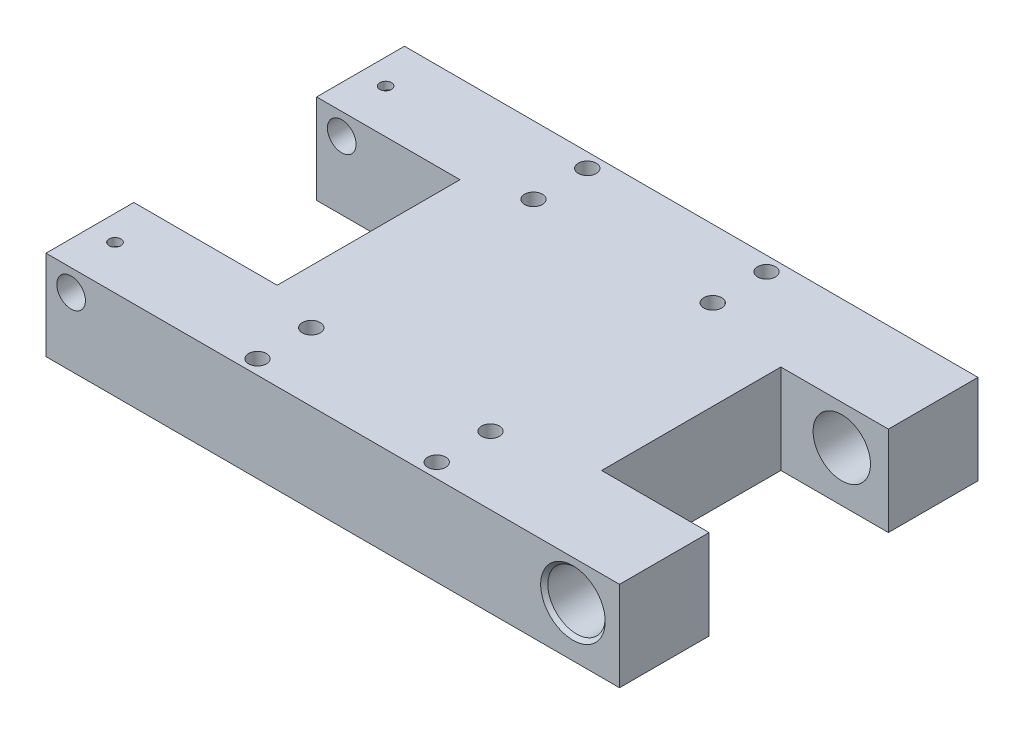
ISO-10303-21;
HEADER;
FILE_DESCRIPTION(('STEP AP214'),'2;1');
FILE_NAME('part.step','',(''),(''),'','','');
FILE_SCHEMA(('AUTOMOTIVE_DESIGN { 1 0 10303 214 1 1 1 1 }'));
ENDSEC;
DATA;
#1=APPLICATION_CONTEXT('core data for automotive mechanical design processes');
#2=APPLICATION_PROTOCOL_DEFINITION('international standard','automotive_design',2000,#1);
#3=PRODUCT_CONTEXT('',#1,'mechanical');
#4=PRODUCT('Part','Part','',(#3));
#5=PRODUCT_RELATED_PRODUCT_CATEGORY('part','',(#4));
#6=PRODUCT_DEFINITION_FORMATION('','',#4);
#7=PRODUCT_DEFINITION_CONTEXT('part definition',#1,'design');
#8=PRODUCT_DEFINITION('design','',#6,#7);
#9=PRODUCT_DEFINITION_SHAPE('','',#8);
#10=(LENGTH_UNIT() NAMED_UNIT(*) SI_UNIT(.MILLI.,.METRE.));
#11=(NAMED_UNIT(*) PLANE_ANGLE_UNIT() SI_UNIT($,.RADIAN.));
#12=(NAMED_UNIT(*) SI_UNIT($,.STERADIAN.) SOLID_ANGLE_UNIT());
#13=UNCERTAINTY_MEASURE_WITH_UNIT(LENGTH_MEASURE(1.E-05),#10,'distance_accuracy_value','');
#14=(GEOMETRIC_REPRESENTATION_CONTEXT(3) GLOBAL_UNCERTAINTY_ASSIGNED_CONTEXT((#13)) GLOBAL_UNIT_ASSIGNED_CONTEXT((#10,
#11,#12)) REPRESENTATION_CONTEXT('',''));
#15=CARTESIAN_POINT('',(0.,0.,0.));
#16=DIRECTION('',(0.,0.,1.));
#17=DIRECTION('',(1.,0.,0.));
#18=AXIS2_PLACEMENT_3D('',#15,#16,#17);
#19=CARTESIAN_POINT('',(80.0000000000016,12.5000000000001,49.9999999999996));
#20=DIRECTION('',(-1.00000000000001,0.,0.));
#21=DIRECTION('',(0.,-1.00000000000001,0.));
#22=AXIS2_PLACEMENT_3D('',#19,#20,#21);
#23=PLANE('',#22);
#24=DIRECTION('',(0.,0.,-0.999999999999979));
#25=VECTOR('',#24,1.);
#26=CARTESIAN_POINT('',(80.000000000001,-12.5000000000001,49.9999999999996));
#27=LINE('',#26,#25);
#28=CARTESIAN_POINT('',(80.000000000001,-12.5000000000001,49.9999999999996));
#29=VERTEX_POINT('',#28);
#30=CARTESIAN_POINT('',(80.000000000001,-12.5000000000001,24.9999999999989));
#31=VERTEX_POINT('',#30);
#32=EDGE_CURVE('E262',#29,#31,#27,.T.);
#33=ORIENTED_EDGE('',*,*,#32,.T.);
#34=DIRECTION('',(0.,1.00000000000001,0.));
#35=VECTOR('',#34,1.);
#36=CARTESIAN_POINT('',(80.0000000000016,12.5000000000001,24.9999999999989));
#37=LINE('',#36,#35);
#38=CARTESIAN_POINT('',(80.0000000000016,12.5000000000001,24.9999999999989));
#39=VERTEX_POINT('',#38);
#40=EDGE_CURVE('E280',#31,#39,#37,.T.);
#41=ORIENTED_EDGE('',*,*,#40,.T.);
#42=DIRECTION('',(0.,0.,-0.999999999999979));
#43=VECTOR('',#42,1.);
#44=CARTESIAN_POINT('',(80.0000000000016,12.5000000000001,49.9999999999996));
#45=LINE('',#44,#43);
#46=CARTESIAN_POINT('',(80.0000000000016,12.5000000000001,49.9999999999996));
#47=VERTEX_POINT('',#46);
#48=EDGE_CURVE('E252',#47,#39,#45,.T.);
#49=ORIENTED_EDGE('',*,*,#48,.F.);
#50=DIRECTION('',(0.,1.00000000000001,0.));
#51=VECTOR('',#50,1.);
#52=CARTESIAN_POINT('',(80.0000000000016,12.5000000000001,49.9999999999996));
#53=LINE('',#52,#51);
#54=EDGE_CURVE('E333',#29,#47,#53,.T.);
#55=ORIENTED_EDGE('',*,*,#54,.F.);
#56=EDGE_LOOP('',(#33,#41,#49,#55));
#57=FACE_BOUND('',#56,.T.);
#58=ADVANCED_FACE('F30',(#57),#23,.F.);
#59=CARTESIAN_POINT('',(67.0000000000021,1.49999999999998,-49.9999999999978));
#60=DIRECTION('',(0.,0.,0.999999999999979));
#61=DIRECTION('',(1.00000000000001,0.,0.));
#62=AXIS2_PLACEMENT_3D('',#59,#60,#61);
#63=CYLINDRICAL_SURFACE('',#62,8.00000000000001);
#64=CARTESIAN_POINT('',(67.0000000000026,1.49999999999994,48.9999999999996));
#65=DIRECTION('',(0.,0.,0.999999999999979));
#66=DIRECTION('',(1.00000000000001,0.,0.));
#67=AXIS2_PLACEMENT_3D('',#64,#65,#66);
#68=CIRCLE('',#67,8.00000000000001);
#69=CARTESIAN_POINT('',(75.0000000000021,1.49999999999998,48.9999999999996));
#70=VERTEX_POINT('',#69);
#71=EDGE_CURVE('E189',#70,#70,#68,.T.);
#72=CARTESIAN_POINT('',(67.0000000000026,1.49999999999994,24.9999999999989));
#73=DIRECTION('',(0.,0.,0.999999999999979));
#74=DIRECTION('',(1.00000000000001,0.,0.));
#75=AXIS2_PLACEMENT_3D('',#72,#73,#74);
#76=CIRCLE('',#75,8.00000000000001);
#77=CARTESIAN_POINT('',(75.0000000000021,1.49999999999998,24.9999999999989));
#78=VERTEX_POINT('',#77);
#79=EDGE_CURVE('E278',#78,#78,#76,.F.);
#80=CARTESIAN_POINT('',(75.0000000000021,1.49999999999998,48.9999999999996));
#81=CARTESIAN_POINT('',(75.0000000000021,1.49999999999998,48.7499999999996));
#82=CARTESIAN_POINT('',(75.0000000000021,1.49999999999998,48.4999999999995));
#83=CARTESIAN_POINT('',(75.0000000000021,1.49999999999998,47.9999999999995));
#84=CARTESIAN_POINT('',(75.0000000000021,1.49999999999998,47.7499999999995));
#85=CARTESIAN_POINT('',(75.0000000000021,1.49999999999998,47.2499999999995));
#86=CARTESIAN_POINT('',(75.0000000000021,1.49999999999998,46.9999999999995));
#87=CARTESIAN_POINT('',(75.0000000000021,1.49999999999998,46.4999999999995));
#88=CARTESIAN_POINT('',(75.0000000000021,1.49999999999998,46.2499999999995));
#89=CARTESIAN_POINT('',(75.0000000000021,1.49999999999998,45.7499999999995));
#90=CARTESIAN_POINT('',(75.0000000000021,1.49999999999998,45.4999999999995));
#91=CARTESIAN_POINT('',(75.0000000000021,1.49999999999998,44.9999999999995));
#92=CARTESIAN_POINT('',(75.0000000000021,1.49999999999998,44.7499999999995));
#93=CARTESIAN_POINT('',(75.0000000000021,1.49999999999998,44.2499999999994));
#94=CARTESIAN_POINT('',(75.0000000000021,1.49999999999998,43.9999999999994));
#95=CARTESIAN_POINT('',(75.0000000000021,1.49999999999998,43.4999999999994));
#96=CARTESIAN_POINT('',(75.0000000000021,1.49999999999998,43.2499999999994));
#97=CARTESIAN_POINT('',(75.0000000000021,1.49999999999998,42.7499999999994));
#98=CARTESIAN_POINT('',(75.0000000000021,1.49999999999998,42.4999999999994));
#99=CARTESIAN_POINT('',(75.0000000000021,1.49999999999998,41.9999999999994));
#100=CARTESIAN_POINT('',(75.0000000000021,1.49999999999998,41.7499999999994));
#101=CARTESIAN_POINT('',(75.0000000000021,1.49999999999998,41.2499999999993));
#102=CARTESIAN_POINT('',(75.0000000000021,1.49999999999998,40.9999999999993));
#103=CARTESIAN_POINT('',(75.0000000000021,1.49999999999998,40.4999999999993));
#104=CARTESIAN_POINT('',(75.0000000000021,1.49999999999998,40.2499999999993));
#105=CARTESIAN_POINT('',(75.0000000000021,1.49999999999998,39.7499999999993));
#106=CARTESIAN_POINT('',(75.0000000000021,1.49999999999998,39.4999999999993));
#107=CARTESIAN_POINT('',(75.0000000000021,1.49999999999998,38.9999999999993));
#108=CARTESIAN_POINT('',(75.0000000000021,1.49999999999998,38.7499999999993));
#109=CARTESIAN_POINT('',(75.0000000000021,1.49999999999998,38.2499999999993));
#110=CARTESIAN_POINT('',(75.0000000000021,1.49999999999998,37.9999999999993));
#111=CARTESIAN_POINT('',(75.0000000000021,1.49999999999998,37.4999999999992));
#112=CARTESIAN_POINT('',(75.0000000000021,1.49999999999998,37.2499999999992));
#113=CARTESIAN_POINT('',(75.0000000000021,1.49999999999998,36.7499999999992));
#114=CARTESIAN_POINT('',(75.0000000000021,1.49999999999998,36.4999999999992));
#115=CARTESIAN_POINT('',(75.0000000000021,1.49999999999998,35.9999999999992));
#116=CARTESIAN_POINT('',(75.0000000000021,1.49999999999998,35.7499999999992));
#117=CARTESIAN_POINT('',(75.0000000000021,1.49999999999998,35.2499999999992));
#118=CARTESIAN_POINT('',(75.0000000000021,1.49999999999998,34.9999999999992));
#119=CARTESIAN_POINT('',(75.0000000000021,1.49999999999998,34.4999999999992));
#120=CARTESIAN_POINT('',(75.0000000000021,1.49999999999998,34.2499999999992));
#121=CARTESIAN_POINT('',(75.0000000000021,1.49999999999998,33.7499999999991));
#122=CARTESIAN_POINT('',(75.0000000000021,1.49999999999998,33.4999999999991));
#123=CARTESIAN_POINT('',(75.0000000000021,1.49999999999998,32.9999999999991));
#124=CARTESIAN_POINT('',(75.0000000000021,1.49999999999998,32.7499999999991));
#125=CARTESIAN_POINT('',(75.0000000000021,1.49999999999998,32.2499999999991));
#126=CARTESIAN_POINT('',(75.0000000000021,1.49999999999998,31.9999999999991));
#127=CARTESIAN_POINT('',(75.0000000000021,1.49999999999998,31.4999999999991));
#128=CARTESIAN_POINT('',(75.0000000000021,1.49999999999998,31.2499999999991));
#129=CARTESIAN_POINT('',(75.0000000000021,1.49999999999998,30.7499999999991));
#130=CARTESIAN_POINT('',(75.0000000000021,1.49999999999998,30.4999999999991));
#131=CARTESIAN_POINT('',(75.0000000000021,1.49999999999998,29.9999999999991));
#132=CARTESIAN_POINT('',(75.0000000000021,1.49999999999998,29.749999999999));
#133=CARTESIAN_POINT('',(75.0000000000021,1.49999999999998,29.249999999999));
#134=CARTESIAN_POINT('',(75.0000000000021,1.49999999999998,28.999999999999));
#135=CARTESIAN_POINT('',(75.0000000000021,1.49999999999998,28.499999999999));
#136=CARTESIAN_POINT('',(75.0000000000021,1.49999999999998,28.249999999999));
#137=CARTESIAN_POINT('',(75.0000000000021,1.49999999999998,27.749999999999));
#138=CARTESIAN_POINT('',(75.0000000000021,1.49999999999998,27.499999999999));
#139=CARTESIAN_POINT('',(75.0000000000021,1.49999999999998,26.999999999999));
#140=CARTESIAN_POINT('',(75.0000000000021,1.49999999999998,26.749999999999));
#141=CARTESIAN_POINT('',(75.0000000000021,1.49999999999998,26.2499999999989));
#142=CARTESIAN_POINT('',(75.0000000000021,1.49999999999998,25.9999999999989));
#143=CARTESIAN_POINT('',(75.0000000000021,1.49999999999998,25.4999999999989));
#144=CARTESIAN_POINT('',(75.0000000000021,1.49999999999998,25.2499999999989));
#145=CARTESIAN_POINT('',(75.0000000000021,1.49999999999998,24.9999999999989));
#146=B_SPLINE_CURVE_WITH_KNOTS('',3,(#80,#81,#82,#83,#84,#85,#86,#87,#88,#89,#90,#91,#92,#93,
#94,#95,#96,#97,#98,#99,#100,#101,#102,#103,#104,#105,#106,#107,#108,#109,#110,#111,#112,#113,
#114,#115,#116,#117,#118,#119,#120,#121,#122,#123,#124,#125,#126,#127,#128,#129,#130,#131,#132,
#133,#134,#135,#136,#137,#138,#139,#140,#141,#142,#143,#144,#145),.UNSPECIFIED.,.F.,.F.,(4,2,2,
2,2,2,2,2,2,2,2,2,2,2,2,2,2,2,2,2,2,2,2,2,2,2,2,2,2,2,2,2,4),(0.,0.750000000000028,
1.50000000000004,2.25000000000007,3.00000000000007,3.7500000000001,4.50000000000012,
5.25000000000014,6.00000000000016,6.75000000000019,7.50000000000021,8.25000000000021,
9.00000000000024,9.75000000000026,10.5000000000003,11.2500000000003,12.0000000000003,
12.7500000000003,13.5000000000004,14.2500000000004,15.0000000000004,15.7500000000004,
16.5000000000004,17.2500000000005,18.0000000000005,18.7500000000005,19.5000000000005,
20.2500000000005,21.0000000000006,21.7500000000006,22.5000000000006,23.2500000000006,
24.0000000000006),.UNSPECIFIED.);
#147=EDGE_CURVE('BSEAM219',#70,#78,#146,.T.);
#148=ORIENTED_EDGE('',*,*,#71,.T.);
#149=ORIENTED_EDGE('',*,*,#79,.T.);
#150=ORIENTED_EDGE('',*,*,#147,.T.);
#151=ORIENTED_EDGE('',*,*,#147,.F.);
#152=EDGE_LOOP('',(#148,#150,#149,#151));
#153=FACE_BOUND('',#152,.T.);
#154=ADVANCED_FACE('F219',(#153),#63,.F.);
#155=CARTESIAN_POINT('',(-79.9999999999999,12.5000000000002,49.9999999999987));
#156=DIRECTION('',(1.00000000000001,0.,0.));
#157=DIRECTION('',(0.,0.,-0.999999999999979));
#158=AXIS2_PLACEMENT_3D('',#155,#156,#157);
#159=PLANE('',#158);
#160=DIRECTION('',(0.,0.,-0.999999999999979));
#161=VECTOR('',#160,1.);
#162=CARTESIAN_POINT('',(-80.,-12.5,49.9999999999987));
#163=LINE('',#162,#161);
#164=CARTESIAN_POINT('',(-80.,-12.5,-25.4999999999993));
#165=VERTEX_POINT('',#164);
#166=CARTESIAN_POINT('',(-80.,-12.5,-49.9999999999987));
#167=VERTEX_POINT('',#166);
#168=EDGE_CURVE('E264',#165,#167,#163,.T.);
#169=ORIENTED_EDGE('',*,*,#168,.F.);
#170=DIRECTION('',(0.,1.00000000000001,0.));
#171=VECTOR('',#170,1.);
#172=CARTESIAN_POINT('',(-79.9999999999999,12.5000000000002,-25.4999999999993));
#173=LINE('',#172,#171);
#174=CARTESIAN_POINT('',(-79.9999999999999,12.5000000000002,-25.4999999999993));
#175=VERTEX_POINT('',#174);
#176=EDGE_CURVE('E274',#165,#175,#173,.T.);
#177=ORIENTED_EDGE('',*,*,#176,.T.);
#178=DIRECTION('',(0.,0.,-0.999999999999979));
#179=VECTOR('',#178,1.);
#180=CARTESIAN_POINT('',(-79.9999999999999,12.5000000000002,49.9999999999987));
#181=LINE('',#180,#179);
#182=CARTESIAN_POINT('',(-79.9999999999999,12.5000000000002,-49.9999999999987));
#183=VERTEX_POINT('',#182);
#184=EDGE_CURVE('E258',#175,#183,#181,.T.);
#185=ORIENTED_EDGE('',*,*,#184,.T.);
#186=DIRECTION('',(0.,-1.00000000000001,0.));
#187=VECTOR('',#186,1.);
#188=CARTESIAN_POINT('',(-79.9999999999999,12.5000000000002,-49.9999999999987));
#189=LINE('',#188,#187);
#190=EDGE_CURVE('E319',#183,#167,#189,.T.);
#191=ORIENTED_EDGE('',*,*,#190,.T.);
#192=EDGE_LOOP('',(#169,#177,#185,#191));
#193=FACE_BOUND('',#192,.T.);
#194=ADVANCED_FACE('F227',(#193),#159,.F.);
#195=CARTESIAN_POINT('',(-73.,6.49999999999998,-49.9999999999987));
#196=DIRECTION('',(0.,0.,0.999999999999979));
#197=DIRECTION('',(1.00000000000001,0.,0.));
#198=AXIS2_PLACEMENT_3D('',#195,#196,#197);
#199=CYLINDRICAL_SURFACE('',#198,4.00000000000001);
#200=CARTESIAN_POINT('',(-73.,2.49999999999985,-36.0999999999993));
#201=CARTESIAN_POINT('',(-73.0884596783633,2.50000690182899,-36.100009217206));
#202=CARTESIAN_POINT('',(-73.1770622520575,2.50296854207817,-36.1071560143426));
#203=CARTESIAN_POINT('',(-73.3517596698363,2.51452886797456,-36.1354911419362));
#204=CARTESIAN_POINT('',(-73.4378472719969,2.52314242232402,-36.1567165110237));
#205=CARTESIAN_POINT('',(-73.6047024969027,2.54508034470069,-36.2122948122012));
#206=CARTESIAN_POINT('',(-73.6854869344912,2.55838887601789,-36.2466036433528));
#207=CARTESIAN_POINT('',(-73.8400766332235,2.58841713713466,-36.3271947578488));
#208=CARTESIAN_POINT('',(-73.9138840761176,2.60513579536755,-36.3734732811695));
#209=CARTESIAN_POINT('',(-74.0561876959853,2.64123099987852,-36.4791067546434));
#210=CARTESIAN_POINT('',(-74.1242937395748,2.66069345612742,-36.5389576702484));
#211=CARTESIAN_POINT('',(-74.2498357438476,2.699705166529,-36.6689888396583));
#212=CARTESIAN_POINT('',(-74.3072661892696,2.71925446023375,-36.7391743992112));
#213=CARTESIAN_POINT('',(-74.4125482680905,2.75727448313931,-36.8919682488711));
#214=CARTESIAN_POINT('',(-74.4598078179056,2.77564840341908,-36.9750111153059));
#215=CARTESIAN_POINT('',(-74.539513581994,2.8078786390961,-37.1487363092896));
#216=CARTESIAN_POINT('',(-74.571967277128,2.82173723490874,-37.2394147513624));
#217=CARTESIAN_POINT('',(-74.6195373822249,2.84243978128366,-37.4213479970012));
#218=CARTESIAN_POINT('',(-74.6354037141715,2.84958550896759,-37.5123710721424));
#219=CARTESIAN_POINT('',(-74.651689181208,2.85692285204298,-37.6960465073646));
#220=CARTESIAN_POINT('',(-74.65211659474,2.85711819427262,-37.7886979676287));
#221=CARTESIAN_POINT('',(-74.6380778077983,2.85078861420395,-37.9655988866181));
#222=CARTESIAN_POINT('',(-74.6247239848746,2.84476560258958,-38.0499581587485));
#223=CARTESIAN_POINT('',(-74.5853648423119,2.82752467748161,-38.2151102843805));
#224=CARTESIAN_POINT('',(-74.5593571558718,2.81630579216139,-38.2959024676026));
#225=CARTESIAN_POINT('',(-74.4949241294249,2.78968541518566,-38.453645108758));
#226=CARTESIAN_POINT('',(-74.4562486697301,2.77420076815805,-38.5304787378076));
#227=CARTESIAN_POINT('',(-74.3677544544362,2.74081383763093,-38.6768602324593));
#228=CARTESIAN_POINT('',(-74.3179313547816,2.72291061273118,-38.7464052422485));
#229=CARTESIAN_POINT('',(-74.2037191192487,2.6849025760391,-38.8822864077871));
#230=CARTESIAN_POINT('',(-74.1384663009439,2.66473811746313,-38.9478819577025));
#231=CARTESIAN_POINT('',(-73.9976825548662,2.62573089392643,-39.0674446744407));
#232=CARTESIAN_POINT('',(-73.9221493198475,2.60688842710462,-39.1214092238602));
#233=CARTESIAN_POINT('',(-73.7607363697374,2.57212067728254,-39.2172347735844));
#234=CARTESIAN_POINT('',(-73.6746640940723,2.55626949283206,-39.2588002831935));
#235=CARTESIAN_POINT('',(-73.495928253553,2.52983680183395,-39.3266030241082));
#236=CARTESIAN_POINT('',(-73.4032682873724,2.51925244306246,-39.3528485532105));
#237=CARTESIAN_POINT('',(-73.2201813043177,2.50507549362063,-39.3877295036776));
#238=CARTESIAN_POINT('',(-73.1299741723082,2.50108878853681,-39.3973591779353));
#239=CARTESIAN_POINT('',(-72.9491525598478,2.49930253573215,-39.4016920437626));
#240=CARTESIAN_POINT('',(-72.8585382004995,2.5015012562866,-39.3963994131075));
#241=CARTESIAN_POINT('',(-72.6840922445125,2.51158252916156,-39.3717547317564));
#242=CARTESIAN_POINT('',(-72.6001446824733,2.51918468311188,-39.3530959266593));
#243=CARTESIAN_POINT('',(-72.4366595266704,2.53901112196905,-39.3032079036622));
#244=CARTESIAN_POINT('',(-72.3571224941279,2.55123599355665,-39.2719770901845));
#245=CARTESIAN_POINT('',(-72.2019380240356,2.57960271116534,-39.1968106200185));
#246=CARTESIAN_POINT('',(-72.1264873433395,2.59585414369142,-39.1525114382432));
#247=CARTESIAN_POINT('',(-71.983821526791,2.63053231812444,-39.0528660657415));
#248=CARTESIAN_POINT('',(-71.9166098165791,2.6489599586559,-38.9975153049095));
#249=CARTESIAN_POINT('',(-71.7873800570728,2.68759704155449,-38.8727956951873));
#250=CARTESIAN_POINT('',(-71.7260563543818,2.70784083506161,-38.8027161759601));
#251=CARTESIAN_POINT('',(-71.6158516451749,2.74666071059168,-38.6529287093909));
#252=CARTESIAN_POINT('',(-71.5669732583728,2.7652364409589,-38.5732187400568));
#253=CARTESIAN_POINT('',(-71.4825771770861,2.79871299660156,-38.404904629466));
#254=CARTESIAN_POINT('',(-71.4472419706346,2.81356275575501,-38.3161980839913));
#255=CARTESIAN_POINT('',(-71.392303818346,2.83718359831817,-38.1332908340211));
#256=CARTESIAN_POINT('',(-71.3726882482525,2.84595955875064,-38.0390946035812));
#257=CARTESIAN_POINT('',(-71.3509887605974,2.8557044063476,-37.8555697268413));
#258=CARTESIAN_POINT('',(-71.3476895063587,2.85721426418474,-37.7664127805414));
#259=CARTESIAN_POINT('',(-71.3554851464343,2.85368821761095,-37.5888715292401));
#260=CARTESIAN_POINT('',(-71.3665779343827,2.84865327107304,-37.50048711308));
#261=CARTESIAN_POINT('',(-71.4018288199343,2.83309509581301,-37.3310669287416));
#262=CARTESIAN_POINT('',(-71.4253804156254,2.82282738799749,-37.2498792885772));
#263=CARTESIAN_POINT('',(-71.4842940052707,2.79815588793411,-37.0925854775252));
#264=CARTESIAN_POINT('',(-71.5196593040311,2.78375093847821,-37.0164807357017));
#265=CARTESIAN_POINT('',(-71.6036193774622,2.75136591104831,-36.8665779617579));
#266=CARTESIAN_POINT('',(-71.6528755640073,2.73322422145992,-36.7931859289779));
#267=CARTESIAN_POINT('',(-71.7622828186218,2.69587135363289,-36.655328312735));
#268=CARTESIAN_POINT('',(-71.8224375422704,2.67665981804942,-36.5908657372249));
#269=CARTESIAN_POINT('',(-71.9569926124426,2.6376982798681,-36.4680058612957));
#270=CARTESIAN_POINT('',(-72.0320998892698,2.61800640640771,-36.4103607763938));
#271=CARTESIAN_POINT('',(-72.191656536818,2.58167573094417,-36.3084598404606));
#272=CARTESIAN_POINT('',(-72.2761101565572,2.56503832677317,-36.2642101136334));
#273=CARTESIAN_POINT('',(-72.4505852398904,2.53694308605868,-36.1913362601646));
#274=CARTESIAN_POINT('',(-72.5404866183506,2.5254014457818,-36.1624575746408));
#275=CARTESIAN_POINT('',(-72.7242807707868,2.50845561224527,-36.1204889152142));
#276=CARTESIAN_POINT('',(-72.818160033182,2.50303213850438,-36.1073493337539));
#277=CARTESIAN_POINT('',(-72.9415557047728,2.50031805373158,-36.1007732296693));
#278=CARTESIAN_POINT('',(-72.9707700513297,2.4999977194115,-36.0999969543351));
#279=CARTESIAN_POINT('',(-73.,2.49999999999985,-36.0999999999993));
#280=B_SPLINE_CURVE_WITH_KNOTS('',3,(#200,#201,#202,#203,#204,#205,#206,#207,#208,#209,#210,
#211,#212,#213,#214,#215,#216,#217,#218,#219,#220,#221,#222,#223,#224,#225,#226,#227,#228,#229,
#230,#231,#232,#233,#234,#235,#236,#237,#238,#239,#240,#241,#242,#243,#244,#245,#246,#247,#248,
#249,#250,#251,#252,#253,#254,#255,#256,#257,#258,#259,#260,#261,#262,#263,#264,#265,#266,#267,
#268,#269,#270,#271,#272,#273,#274,#275,#276,#277,#278,#279),.UNSPECIFIED.,.T.,.F.,(4,2,2,2,2,2,
2,2,2,2,2,2,2,2,2,2,2,2,2,2,2,2,2,2,2,2,2,2,2,2,2,2,2,2,2,2,2,2,2,4),(0.,0.265297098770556,
0.531294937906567,0.796403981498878,1.06142984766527,1.33841878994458,1.61555043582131,
1.90598404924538,2.19627075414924,2.4727764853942,2.74913395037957,3.00480633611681,
3.2605265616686,3.52163539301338,3.78284615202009,4.06565185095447,4.34852112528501,
4.6376739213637,4.92666995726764,5.1976814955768,5.46861716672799,5.72643264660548,
5.98428085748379,6.25011488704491,6.5160590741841,6.80064580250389,7.08529238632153,
7.37364985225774,7.6617755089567,7.9280782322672,8.19434198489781,8.44869772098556,
8.70312467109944,8.97267479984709,9.24231550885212,9.53104085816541,9.81989801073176,
10.1038095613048,10.3868238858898,10.4744866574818),.UNSPECIFIED.);
#281=CARTESIAN_POINT('',(-73.,2.49999999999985,-36.0999999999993));
#282=VERTEX_POINT('',#281);
#283=EDGE_CURVE('E150',#282,#282,#280,.T.);
#284=ORIENTED_EDGE('',*,*,#283,.T.);
#285=EDGE_LOOP('',(#284));
#286=FACE_BOUND('',#285,.T.);
#287=CARTESIAN_POINT('',(-73.,10.5,-36.0999999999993));
#288=CARTESIAN_POINT('',(-72.9115403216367,10.4999930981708,-36.100009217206));
#289=CARTESIAN_POINT('',(-72.8229377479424,10.4970314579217,-36.1071560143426));
#290=CARTESIAN_POINT('',(-72.6482403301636,10.4854711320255,-36.1354911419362));
#291=CARTESIAN_POINT('',(-72.5621527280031,10.476857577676,-36.1567165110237));
#292=CARTESIAN_POINT('',(-72.3952975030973,10.4549196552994,-36.2122948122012));
#293=CARTESIAN_POINT('',(-72.3145130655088,10.4416111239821,-36.2466036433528));
#294=CARTESIAN_POINT('',(-72.1599233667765,10.4115828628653,-36.3271947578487));
#295=CARTESIAN_POINT('',(-72.0861159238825,10.3948642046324,-36.3734732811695));
#296=CARTESIAN_POINT('',(-71.9438123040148,10.3587690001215,-36.4791067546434));
#297=CARTESIAN_POINT('',(-71.8757062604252,10.3393065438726,-36.5389576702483));
#298=CARTESIAN_POINT('',(-71.7501642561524,10.300294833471,-36.6689888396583));
#299=CARTESIAN_POINT('',(-71.6927338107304,10.2807455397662,-36.7391743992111));
#300=CARTESIAN_POINT('',(-71.5874517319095,10.2427255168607,-36.8919682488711));
#301=CARTESIAN_POINT('',(-71.5401921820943,10.224351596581,-36.9750111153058));
#302=CARTESIAN_POINT('',(-71.4604864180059,10.1921213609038,-37.1487363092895));
#303=CARTESIAN_POINT('',(-71.4280327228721,10.178262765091,-37.2394147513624));
#304=CARTESIAN_POINT('',(-71.3804626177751,10.1575602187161,-37.4213479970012));
#305=CARTESIAN_POINT('',(-71.3645962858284,10.1504144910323,-37.5123710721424));
#306=CARTESIAN_POINT('',(-71.3483108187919,10.1430771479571,-37.6960465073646));
#307=CARTESIAN_POINT('',(-71.34788340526,10.1428818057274,-37.7886979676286));
#308=CARTESIAN_POINT('',(-71.3619221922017,10.1492113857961,-37.9655988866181));
#309=CARTESIAN_POINT('',(-71.3752760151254,10.1552343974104,-38.0499581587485));
#310=CARTESIAN_POINT('',(-71.414635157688,10.1724753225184,-38.2151102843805));
#311=CARTESIAN_POINT('',(-71.4406428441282,10.1836942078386,-38.2959024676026));
#312=CARTESIAN_POINT('',(-71.5050758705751,10.2103145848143,-38.453645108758));
#313=CARTESIAN_POINT('',(-71.5437513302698,10.2257992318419,-38.5304787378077));
#314=CARTESIAN_POINT('',(-71.6322455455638,10.2591861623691,-38.6768602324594));
#315=CARTESIAN_POINT('',(-71.6820686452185,10.2770893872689,-38.7464052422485));
#316=CARTESIAN_POINT('',(-71.7962808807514,10.315097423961,-38.8822864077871));
#317=CARTESIAN_POINT('',(-71.8615336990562,10.3352618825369,-38.9478819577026));
#318=CARTESIAN_POINT('',(-72.0023174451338,10.3742691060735,-39.0674446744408));
#319=CARTESIAN_POINT('',(-72.0778506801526,10.3931115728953,-39.1214092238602));
#320=CARTESIAN_POINT('',(-72.2392636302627,10.4278793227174,-39.2172347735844));
#321=CARTESIAN_POINT('',(-72.3253359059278,10.4437305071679,-39.2588002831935));
#322=CARTESIAN_POINT('',(-72.5040717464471,10.4701631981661,-39.3266030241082));
#323=CARTESIAN_POINT('',(-72.5967317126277,10.4807475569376,-39.3528485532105));
#324=CARTESIAN_POINT('',(-72.7798186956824,10.4949245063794,-39.3877295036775));
#325=CARTESIAN_POINT('',(-72.8700258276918,10.4989112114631,-39.3973591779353));
#326=CARTESIAN_POINT('',(-73.0508474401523,10.5006974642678,-39.4016920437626));
#327=CARTESIAN_POINT('',(-73.1414617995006,10.4984987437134,-39.3963994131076));
#328=CARTESIAN_POINT('',(-73.3159077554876,10.4884174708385,-39.3717547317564));
#329=CARTESIAN_POINT('',(-73.3998553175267,10.4808153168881,-39.3530959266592));
#330=CARTESIAN_POINT('',(-73.5633404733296,10.4609888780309,-39.3032079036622));
#331=CARTESIAN_POINT('',(-73.6428775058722,10.4487640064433,-39.2719770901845));
#332=CARTESIAN_POINT('',(-73.7980619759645,10.4203972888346,-39.1968106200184));
#333=CARTESIAN_POINT('',(-73.8735126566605,10.4041458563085,-39.1525114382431));
#334=CARTESIAN_POINT('',(-74.0161784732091,10.3694676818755,-39.0528660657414));
#335=CARTESIAN_POINT('',(-74.0833901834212,10.351040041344,-38.9975153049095));
#336=CARTESIAN_POINT('',(-74.2126199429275,10.3124029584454,-38.8727956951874));
#337=CARTESIAN_POINT('',(-74.2739436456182,10.2921591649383,-38.80271617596));
#338=CARTESIAN_POINT('',(-74.3841483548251,10.2533392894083,-38.6529287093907));
#339=CARTESIAN_POINT('',(-74.4330267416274,10.2347635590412,-38.5732187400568));
#340=CARTESIAN_POINT('',(-74.5174228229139,10.2012870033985,-38.404904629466));
#341=CARTESIAN_POINT('',(-74.5527580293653,10.186437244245,-38.3161980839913));
#342=CARTESIAN_POINT('',(-74.6076961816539,10.1628164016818,-38.1332908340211));
#343=CARTESIAN_POINT('',(-74.6273117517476,10.1540404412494,-38.0390946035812));
#344=CARTESIAN_POINT('',(-74.6490112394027,10.1442955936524,-37.8555697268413));
#345=CARTESIAN_POINT('',(-74.6523104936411,10.1427857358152,-37.7664127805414));
#346=CARTESIAN_POINT('',(-74.6445148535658,10.146311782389,-37.5888715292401));
#347=CARTESIAN_POINT('',(-74.6334220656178,10.151346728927,-37.5004871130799));
#348=CARTESIAN_POINT('',(-74.5981711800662,10.166904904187,-37.3310669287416));
#349=CARTESIAN_POINT('',(-74.5746195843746,10.1771726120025,-37.2498792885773));
#350=CARTESIAN_POINT('',(-74.5157059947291,10.2018441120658,-37.0925854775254));
#351=CARTESIAN_POINT('',(-74.4803406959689,10.2162490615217,-37.0164807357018));
#352=CARTESIAN_POINT('',(-74.396380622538,10.2486340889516,-36.8665779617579));
#353=CARTESIAN_POINT('',(-74.3471244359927,10.26677577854,-36.7931859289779));
#354=CARTESIAN_POINT('',(-74.2377171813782,10.3041286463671,-36.6553283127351));
#355=CARTESIAN_POINT('',(-74.1775624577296,10.3233401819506,-36.5908657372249));
#356=CARTESIAN_POINT('',(-74.0430073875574,10.3623017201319,-36.4680058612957));
#357=CARTESIAN_POINT('',(-73.9679001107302,10.3819935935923,-36.4103607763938));
#358=CARTESIAN_POINT('',(-73.808343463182,10.4183242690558,-36.3084598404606));
#359=CARTESIAN_POINT('',(-73.7238898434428,10.4349616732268,-36.2642101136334));
#360=CARTESIAN_POINT('',(-73.5494147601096,10.4630569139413,-36.1913362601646));
#361=CARTESIAN_POINT('',(-73.4595133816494,10.4745985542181,-36.1624575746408));
#362=CARTESIAN_POINT('',(-73.2757192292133,10.4915443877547,-36.1204889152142));
#363=CARTESIAN_POINT('',(-73.1818399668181,10.4969678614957,-36.1073493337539));
#364=CARTESIAN_POINT('',(-73.0584442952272,10.4996819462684,-36.1007732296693));
#365=CARTESIAN_POINT('',(-73.0292299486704,10.5000022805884,-36.0999969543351));
#366=CARTESIAN_POINT('',(-73.,10.5,-36.0999999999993));
#367=B_SPLINE_CURVE_WITH_KNOTS('',3,(#287,#288,#289,#290,#291,#292,#293,#294,#295,#296,#297,
#298,#299,#300,#301,#302,#303,#304,#305,#306,#307,#308,#309,#310,#311,#312,#313,#314,#315,#316,
#317,#318,#319,#320,#321,#322,#323,#324,#325,#326,#327,#328,#329,#330,#331,#332,#333,#334,#335,
#336,#337,#338,#339,#340,#341,#342,#343,#344,#345,#346,#347,#348,#349,#350,#351,#352,#353,#354,
#355,#356,#357,#358,#359,#360,#361,#362,#363,#364,#365,#366),.UNSPECIFIED.,.T.,.F.,(4,2,2,2,2,2,
2,2,2,2,2,2,2,2,2,2,2,2,2,2,2,2,2,2,2,2,2,2,2,2,2,2,2,2,2,2,2,2,2,4),(0.,0.265297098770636,
0.531294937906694,0.796403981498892,1.06142984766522,1.33841878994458,1.61555043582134,
1.90598404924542,2.19627075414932,2.47277648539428,2.74913395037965,3.00480633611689,
3.26052656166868,3.52163539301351,3.78284615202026,4.06565185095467,4.3485211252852,
4.63767392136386,4.92666995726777,5.19768149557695,5.46861716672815,5.72643264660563,
5.98428085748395,6.25011488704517,6.51605907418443,6.80064580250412,7.08529238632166,
7.37364985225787,7.66177550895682,7.92807823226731,8.19434198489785,8.44869772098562,
8.70312467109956,8.97267479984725,9.24231550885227,9.53104085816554,9.81989801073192,
10.1038095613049,10.3868238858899,10.4744866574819),.UNSPECIFIED.);
#368=CARTESIAN_POINT('',(-73.,10.5,-36.0999999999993));
#369=VERTEX_POINT('',#368);
#370=EDGE_CURVE('E137',#369,#369,#367,.T.);
#371=ORIENTED_EDGE('',*,*,#370,.T.);
#372=EDGE_LOOP('',(#371));
#373=FACE_BOUND('',#372,.T.);
#374=CARTESIAN_POINT('',(-73.,6.49999999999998,-25.4999999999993));
#375=DIRECTION('',(0.,0.,-0.999999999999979));
#376=DIRECTION('',(-1.00000000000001,0.,0.));
#377=AXIS2_PLACEMENT_3D('',#374,#375,#376);
#378=CIRCLE('',#377,4.00000000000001);
#379=CARTESIAN_POINT('',(-77.,6.49999999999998,-25.4999999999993));
#380=VERTEX_POINT('',#379);
#381=EDGE_CURVE('E271',#380,#380,#378,.F.);
#382=ORIENTED_EDGE('',*,*,#381,.T.);
#383=EDGE_LOOP('',(#382));
#384=FACE_BOUND('',#383,.T.);
#385=CARTESIAN_POINT('',(-73.,6.49999999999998,-49.9999999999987));
#386=DIRECTION('',(0.,0.,0.999999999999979));
#387=DIRECTION('',(1.00000000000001,0.,0.));
#388=AXIS2_PLACEMENT_3D('',#385,#386,#387);
#389=CIRCLE('',#388,4.00000000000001);
#390=CARTESIAN_POINT('',(-68.9999999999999,6.49999999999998,-49.9999999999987));
#391=VERTEX_POINT('',#390);
#392=EDGE_CURVE('E316',#391,#391,#389,.T.);
#393=ORIENTED_EDGE('',*,*,#392,.F.);
#394=EDGE_LOOP('',(#393));
#395=FACE_BOUND('',#394,.T.);
#396=ADVANCED_FACE('F374',(#286,#373,#384,#395),#199,.F.);
#397=CARTESIAN_POINT('',(-79.9999999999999,12.5000000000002,49.9999999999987));
#398=VERTEX_POINT('',#397);
#399=CARTESIAN_POINT('',(-79.9999999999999,12.5000000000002,25.4999999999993));
#400=VERTEX_POINT('',#399);
#401=EDGE_CURVE('E253',#398,#400,#181,.T.);
#402=ORIENTED_EDGE('',*,*,#401,.T.);
#403=DIRECTION('',(0.,-1.00000000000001,0.));
#404=VECTOR('',#403,1.);
#405=CARTESIAN_POINT('',(-79.9999999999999,12.5000000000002,25.4999999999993));
#406=LINE('',#405,#404);
#407=CARTESIAN_POINT('',(-80.,-12.5,25.4999999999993));
#408=VERTEX_POINT('',#407);
#409=EDGE_CURVE('E53',#400,#408,#406,.T.);
#410=ORIENTED_EDGE('',*,*,#409,.T.);
#411=CARTESIAN_POINT('',(-80.,-12.5,49.9999999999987));
#412=VERTEX_POINT('',#411);
#413=EDGE_CURVE('E193',#412,#408,#163,.T.);
#414=ORIENTED_EDGE('',*,*,#413,.F.);
#415=DIRECTION('',(0.,-1.00000000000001,0.));
#416=VECTOR('',#415,1.);
#417=CARTESIAN_POINT('',(-79.9999999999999,12.5000000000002,49.9999999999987));
#418=LINE('',#417,#416);
#419=EDGE_CURVE('E328',#398,#412,#418,.T.);
#420=ORIENTED_EDGE('',*,*,#419,.F.);
#421=EDGE_LOOP('',(#402,#410,#414,#420));
#422=FACE_BOUND('',#421,.T.);
#423=ADVANCED_FACE('F32',(#422),#159,.F.);
#424=CARTESIAN_POINT('',(-80.,-12.5,49.9999999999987));
#425=DIRECTION('',(0.,1.00000000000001,0.));
#426=DIRECTION('',(0.,0.,0.999999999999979));
#427=AXIS2_PLACEMENT_3D('',#424,#425,#426);
#428=PLANE('',#427);
#429=CARTESIAN_POINT('',(25.000000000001,-12.5000000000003,-30.9999999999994));
#430=DIRECTION('',(0.,-1.00000000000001,0.));
#431=DIRECTION('',(0.,0.,-0.999999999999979));
#432=AXIS2_PLACEMENT_3D('',#429,#430,#431);
#433=CIRCLE('',#432,2.5);
#434=CARTESIAN_POINT('',(25.000000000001,-12.5000000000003,-33.4999999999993));
#435=VERTEX_POINT('',#434);
#436=EDGE_CURVE('E562',#435,#435,#433,.T.);
#437=ORIENTED_EDGE('',*,*,#436,.F.);
#438=EDGE_LOOP('',(#437));
#439=FACE_BOUND('',#438,.T.);
#440=CARTESIAN_POINT('',(25.0000000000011,-12.5000000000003,-45.9999999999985));
#441=DIRECTION('',(0.,-1.00000000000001,0.));
#442=DIRECTION('',(0.,0.,-0.999999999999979));
#443=AXIS2_PLACEMENT_3D('',#440,#441,#442);
#444=CIRCLE('',#443,2.5);
#445=CARTESIAN_POINT('',(25.0000000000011,-12.5000000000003,-48.4999999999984));
#446=VERTEX_POINT('',#445);
#447=EDGE_CURVE('E556',#446,#446,#444,.T.);
#448=ORIENTED_EDGE('',*,*,#447,.F.);
#449=EDGE_LOOP('',(#448));
#450=FACE_BOUND('',#449,.T.);
#451=CARTESIAN_POINT('',(-25.,-12.5,-45.9999999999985));
#452=DIRECTION('',(0.,-1.00000000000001,0.));
#453=DIRECTION('',(0.,0.,-0.999999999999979));
#454=AXIS2_PLACEMENT_3D('',#451,#452,#453);
#455=CIRCLE('',#454,2.5);
#456=CARTESIAN_POINT('',(-25.,-12.5,-48.4999999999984));
#457=VERTEX_POINT('',#456);
#458=EDGE_CURVE('E550',#457,#457,#455,.T.);
#459=ORIENTED_EDGE('',*,*,#458,.F.);
#460=EDGE_LOOP('',(#459));
#461=FACE_BOUND('',#460,.T.);
#462=CARTESIAN_POINT('',(-25.,-12.5,-30.9999999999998));
#463=DIRECTION('',(0.,-1.00000000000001,0.));
#464=DIRECTION('',(0.,0.,-0.999999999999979));
#465=AXIS2_PLACEMENT_3D('',#462,#463,#464);
#466=CIRCLE('',#465,2.5);
#467=CARTESIAN_POINT('',(-25.,-12.5,-33.4999999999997));
#468=VERTEX_POINT('',#467);
#469=EDGE_CURVE('E516',#468,#468,#466,.T.);
#470=ORIENTED_EDGE('',*,*,#469,.F.);
#471=EDGE_LOOP('',(#470));
#472=FACE_BOUND('',#471,.T.);
#473=CARTESIAN_POINT('',(25.0000000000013,-12.5000000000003,30.9999999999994));
#474=DIRECTION('',(0.,-1.00000000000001,0.));
#475=DIRECTION('',(0.,0.,-0.999999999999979));
#476=AXIS2_PLACEMENT_3D('',#473,#474,#475);
#477=CIRCLE('',#476,2.5);
#478=CARTESIAN_POINT('',(25.0000000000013,-12.5000000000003,28.4999999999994));
#479=VERTEX_POINT('',#478);
#480=EDGE_CURVE('E509',#479,#479,#477,.T.);
#481=ORIENTED_EDGE('',*,*,#480,.F.);
#482=EDGE_LOOP('',(#481));
#483=FACE_BOUND('',#482,.T.);
#484=CARTESIAN_POINT('',(25.0000000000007,-12.5000000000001,46.0000000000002));
#485=DIRECTION('',(0.,-1.00000000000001,0.));
#486=DIRECTION('',(0.,0.,-0.999999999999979));
#487=AXIS2_PLACEMENT_3D('',#484,#485,#486);
#488=CIRCLE('',#487,2.5);
#489=CARTESIAN_POINT('',(25.0000000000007,-12.5000000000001,43.5000000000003));
#490=VERTEX_POINT('',#489);
#491=EDGE_CURVE('E514',#490,#490,#488,.T.);
#492=ORIENTED_EDGE('',*,*,#491,.F.);
#493=EDGE_LOOP('',(#492));
#494=FACE_BOUND('',#493,.T.);
#495=CARTESIAN_POINT('',(-24.9999999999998,-12.5,46.0000000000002));
#496=DIRECTION('',(0.,-1.00000000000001,0.));
#497=DIRECTION('',(0.,0.,-0.999999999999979));
#498=AXIS2_PLACEMENT_3D('',#495,#496,#497);
#499=CIRCLE('',#498,2.5);
#500=CARTESIAN_POINT('',(-24.9999999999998,-12.5,43.5000000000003));
#501=VERTEX_POINT('',#500);
#502=EDGE_CURVE('E525',#501,#501,#499,.T.);
#503=ORIENTED_EDGE('',*,*,#502,.F.);
#504=EDGE_LOOP('',(#503));
#505=FACE_BOUND('',#504,.T.);
#506=CARTESIAN_POINT('',(-24.9999999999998,-12.5,30.9999999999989));
#507=DIRECTION('',(0.,-1.00000000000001,0.));
#508=DIRECTION('',(0.,0.,-0.999999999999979));
#509=AXIS2_PLACEMENT_3D('',#506,#507,#508);
#510=CIRCLE('',#509,2.5);
#511=CARTESIAN_POINT('',(-24.9999999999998,-12.5,28.499999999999));
#512=VERTEX_POINT('',#511);
#513=EDGE_CURVE('E134',#512,#512,#510,.T.);
#514=ORIENTED_EDGE('',*,*,#513,.F.);
#515=EDGE_LOOP('',(#514));
#516=FACE_BOUND('',#515,.T.);
#517=DIRECTION('',(0.,0.,0.999999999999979));
#518=VECTOR('',#517,1.);
#519=CARTESIAN_POINT('',(50.0000000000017,-12.5000000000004,-24.9999999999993));
#520=LINE('',#519,#518);
#521=CARTESIAN_POINT('',(50.0000000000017,-12.5000000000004,-24.9999999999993));
#522=VERTEX_POINT('',#521);
#523=CARTESIAN_POINT('',(50.0000000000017,-12.5000000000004,24.9999999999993));
#524=VERTEX_POINT('',#523);
#525=EDGE_CURVE('E418',#522,#524,#520,.T.);
#526=ORIENTED_EDGE('',*,*,#525,.T.);
#527=DIRECTION('',(1.00000000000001,0.,0.));
#528=VECTOR('',#527,1.);
#529=CARTESIAN_POINT('',(90.0000000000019,-12.5000000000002,24.9999999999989));
#530=LINE('',#529,#528);
#531=EDGE_CURVE('E416',#524,#31,#530,.T.);
#532=ORIENTED_EDGE('',*,*,#531,.T.);
#533=ORIENTED_EDGE('',*,*,#32,.F.);
#534=DIRECTION('',(1.00000000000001,0.,0.));
#535=VECTOR('',#534,1.);
#536=CARTESIAN_POINT('',(-80.,-12.5,49.9999999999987));
#537=LINE('',#536,#535);
#538=EDGE_CURVE('E331',#412,#29,#537,.T.);
#539=ORIENTED_EDGE('',*,*,#538,.F.);
#540=ORIENTED_EDGE('',*,*,#413,.T.);
#541=DIRECTION('',(1.00000000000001,0.,0.));
#542=VECTOR('',#541,1.);
#543=CARTESIAN_POINT('',(-90.0000000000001,-12.5000000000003,25.4999999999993));
#544=LINE('',#543,#542);
#545=CARTESIAN_POINT('',(-40.,-12.5,25.4999999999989));
#546=VERTEX_POINT('',#545);
#547=EDGE_CURVE('E297',#408,#546,#544,.T.);
#548=ORIENTED_EDGE('',*,*,#547,.T.);
#549=DIRECTION('',(0.,0.,-0.999999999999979));
#550=VECTOR('',#549,1.);
#551=CARTESIAN_POINT('',(-40.,-12.5,-25.4999999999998));
#552=LINE('',#551,#550);
#553=CARTESIAN_POINT('',(-40.,-12.5,-25.4999999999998));
#554=VERTEX_POINT('',#553);
#555=EDGE_CURVE('E300',#546,#554,#552,.T.);
#556=ORIENTED_EDGE('',*,*,#555,.T.);
#557=DIRECTION('',(-1.00000000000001,0.,0.));
#558=VECTOR('',#557,1.);
#559=CARTESIAN_POINT('',(-90.0000000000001,-12.5000000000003,-25.4999999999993));
#560=LINE('',#559,#558);
#561=EDGE_CURVE('E303',#554,#165,#560,.T.);
#562=ORIENTED_EDGE('',*,*,#561,.T.);
#563=ORIENTED_EDGE('',*,*,#168,.T.);
#564=DIRECTION('',(1.00000000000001,0.,0.));
#565=VECTOR('',#564,1.);
#566=CARTESIAN_POINT('',(-80.,-12.5,-49.9999999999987));
#567=LINE('',#566,#565);
#568=CARTESIAN_POINT('',(80.0000000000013,-12.5000000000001,-49.9999999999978));
#569=VERTEX_POINT('',#568);
#570=EDGE_CURVE('E322',#167,#569,#567,.T.);
#571=ORIENTED_EDGE('',*,*,#570,.T.);
#572=CARTESIAN_POINT('',(80.000000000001,-12.5000000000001,-24.9999999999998));
#573=VERTEX_POINT('',#572);
#574=EDGE_CURVE('E256',#573,#569,#27,.T.);
#575=ORIENTED_EDGE('',*,*,#574,.F.);
#576=DIRECTION('',(-1.00000000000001,0.,0.));
#577=VECTOR('',#576,1.);
#578=CARTESIAN_POINT('',(90.0000000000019,-12.5000000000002,-24.9999999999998));
#579=LINE('',#578,#577);
#580=EDGE_CURVE('E421',#573,#522,#579,.T.);
#581=ORIENTED_EDGE('',*,*,#580,.T.);
#582=EDGE_LOOP('',(#526,#532,#533,#539,#540,#548,#556,#562,#563,#571,#575,#581));
#583=FACE_BOUND('',#582,.T.);
#584=ADVANCED_FACE('F234',(#439,#450,#461,#472,#483,#494,#505,#516,#583),#428,.F.);
#585=CARTESIAN_POINT('',(80.0000000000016,12.5000000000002,-24.9999999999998));
#586=VERTEX_POINT('',#585);
#587=CARTESIAN_POINT('',(80.000000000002,12.5000000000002,-49.9999999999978));
#588=VERTEX_POINT('',#587);
#589=EDGE_CURVE('E245',#586,#588,#45,.T.);
#590=ORIENTED_EDGE('',*,*,#589,.F.);
#591=DIRECTION('',(0.,-1.00000000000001,0.));
#592=VECTOR('',#591,1.);
#593=CARTESIAN_POINT('',(80.0000000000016,12.5000000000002,-24.9999999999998));
#594=LINE('',#593,#592);
#595=EDGE_CURVE('E45',#586,#573,#594,.T.);
#596=ORIENTED_EDGE('',*,*,#595,.T.);
#597=ORIENTED_EDGE('',*,*,#574,.T.);
#598=DIRECTION('',(0.,1.00000000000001,0.));
#599=VECTOR('',#598,1.);
#600=CARTESIAN_POINT('',(80.000000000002,12.5000000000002,-49.9999999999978));
#601=LINE('',#600,#599);
#602=EDGE_CURVE('E248',#569,#588,#601,.T.);
#603=ORIENTED_EDGE('',*,*,#602,.T.);
#604=EDGE_LOOP('',(#590,#596,#597,#603));
#605=FACE_BOUND('',#604,.T.);
#606=ADVANCED_FACE('F222',(#605),#23,.F.);
#607=CARTESIAN_POINT('',(-79.9999999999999,12.5000000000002,49.9999999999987));
#608=DIRECTION('',(0.,-1.00000000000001,0.));
#609=DIRECTION('',(0.,0.,-0.999999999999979));
#610=AXIS2_PLACEMENT_3D('',#607,#608,#609);
#611=PLANE('',#610);
#612=CARTESIAN_POINT('',(25.0000000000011,12.5000000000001,-30.9999999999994));
#613=DIRECTION('',(0.,-1.00000000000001,0.));
#614=DIRECTION('',(0.,0.,-0.999999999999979));
#615=AXIS2_PLACEMENT_3D('',#612,#613,#614);
#616=CIRCLE('',#615,2.5);
#617=CARTESIAN_POINT('',(25.0000000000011,12.5000000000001,-33.4999999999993));
#618=VERTEX_POINT('',#617);
#619=EDGE_CURVE('E565',#618,#618,#616,.T.);
#620=ORIENTED_EDGE('',*,*,#619,.T.);
#621=EDGE_LOOP('',(#620));
#622=FACE_BOUND('',#621,.T.);
#623=CARTESIAN_POINT('',(25.0000000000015,12.5000000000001,-45.9999999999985));
#624=DIRECTION('',(0.,-1.00000000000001,0.));
#625=DIRECTION('',(0.,0.,-0.999999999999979));
#626=AXIS2_PLACEMENT_3D('',#623,#624,#625);
#627=CIRCLE('',#626,2.5);
#628=CARTESIAN_POINT('',(25.0000000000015,12.5000000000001,-48.4999999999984));
#629=VERTEX_POINT('',#628);
#630=EDGE_CURVE('E559',#629,#629,#627,.T.);
#631=ORIENTED_EDGE('',*,*,#630,.T.);
#632=EDGE_LOOP('',(#631));
#633=FACE_BOUND('',#632,.T.);
#634=CARTESIAN_POINT('',(-25.,12.5,-45.9999999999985));
#635=DIRECTION('',(0.,-1.00000000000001,0.));
#636=DIRECTION('',(0.,0.,-0.999999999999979));
#637=AXIS2_PLACEMENT_3D('',#634,#635,#636);
#638=CIRCLE('',#637,2.5);
#639=CARTESIAN_POINT('',(-25.,12.5,-48.4999999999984));
#640=VERTEX_POINT('',#639);
#641=EDGE_CURVE('E553',#640,#640,#638,.T.);
#642=ORIENTED_EDGE('',*,*,#641,.T.);
#643=EDGE_LOOP('',(#642));
#644=FACE_BOUND('',#643,.T.);
#645=CARTESIAN_POINT('',(-25.,12.5,-30.9999999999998));
#646=DIRECTION('',(0.,-1.00000000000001,0.));
#647=DIRECTION('',(0.,0.,-0.999999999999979));
#648=AXIS2_PLACEMENT_3D('',#645,#646,#647);
#649=CIRCLE('',#648,2.5);
#650=CARTESIAN_POINT('',(-25.,12.5,-33.4999999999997));
#651=VERTEX_POINT('',#650);
#652=EDGE_CURVE('E547',#651,#651,#649,.T.);
#653=ORIENTED_EDGE('',*,*,#652,.T.);
#654=EDGE_LOOP('',(#653));
#655=FACE_BOUND('',#654,.T.);
#656=CARTESIAN_POINT('',(25.0000000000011,12.5000000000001,30.9999999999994));
#657=DIRECTION('',(0.,-1.00000000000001,0.));
#658=DIRECTION('',(0.,0.,-0.999999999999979));
#659=AXIS2_PLACEMENT_3D('',#656,#657,#658);
#660=CIRCLE('',#659,2.5);
#661=CARTESIAN_POINT('',(25.0000000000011,12.5000000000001,28.4999999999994));
#662=VERTEX_POINT('',#661);
#663=EDGE_CURVE('E506',#662,#662,#660,.T.);
#664=ORIENTED_EDGE('',*,*,#663,.T.);
#665=EDGE_LOOP('',(#664));
#666=FACE_BOUND('',#665,.T.);
#667=CARTESIAN_POINT('',(25.000000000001,12.5,46.0000000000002));
#668=DIRECTION('',(0.,-1.00000000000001,0.));
#669=DIRECTION('',(0.,0.,-0.999999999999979));
#670=AXIS2_PLACEMENT_3D('',#667,#668,#669);
#671=CIRCLE('',#670,2.5);
#672=CARTESIAN_POINT('',(25.000000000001,12.5,43.5000000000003));
#673=VERTEX_POINT('',#672);
#674=EDGE_CURVE('E511',#673,#673,#671,.T.);
#675=ORIENTED_EDGE('',*,*,#674,.T.);
#676=EDGE_LOOP('',(#675));
#677=FACE_BOUND('',#676,.T.);
#678=CARTESIAN_POINT('',(-25.,12.5,46.0000000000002));
#679=DIRECTION('',(0.,-1.00000000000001,0.));
#680=DIRECTION('',(0.,0.,-0.999999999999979));
#681=AXIS2_PLACEMENT_3D('',#678,#679,#680);
#682=CIRCLE('',#681,2.5);
#683=CARTESIAN_POINT('',(-25.,12.5,43.5000000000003));
#684=VERTEX_POINT('',#683);
#685=EDGE_CURVE('E522',#684,#684,#682,.T.);
#686=ORIENTED_EDGE('',*,*,#685,.T.);
#687=EDGE_LOOP('',(#686));
#688=FACE_BOUND('',#687,.T.);
#689=CARTESIAN_POINT('',(-25.,12.5,30.9999999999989));
#690=DIRECTION('',(0.,-1.00000000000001,0.));
#691=DIRECTION('',(0.,0.,-0.999999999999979));
#692=AXIS2_PLACEMENT_3D('',#689,#690,#691);
#693=CIRCLE('',#692,2.5);
#694=CARTESIAN_POINT('',(-25.,12.5,28.499999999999));
#695=VERTEX_POINT('',#694);
#696=EDGE_CURVE('E140',#695,#695,#693,.T.);
#697=ORIENTED_EDGE('',*,*,#696,.T.);
#698=EDGE_LOOP('',(#697));
#699=FACE_BOUND('',#698,.T.);
#700=CARTESIAN_POINT('',(-73.,12.5,-37.7499999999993));
#701=DIRECTION('',(0.,1.00000000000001,0.));
#702=DIRECTION('',(0.,0.,0.999999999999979));
#703=AXIS2_PLACEMENT_3D('',#700,#701,#702);
#704=CIRCLE('',#703,1.65);
#705=CARTESIAN_POINT('',(-73.,12.5,-36.0999999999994));
#706=VERTEX_POINT('',#705);
#707=EDGE_CURVE('E133',#706,#706,#704,.T.);
#708=ORIENTED_EDGE('',*,*,#707,.F.);
#709=EDGE_LOOP('',(#708));
#710=FACE_BOUND('',#709,.T.);
#711=CARTESIAN_POINT('',(-73.,12.5,37.7499999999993));
#712=DIRECTION('',(0.,1.00000000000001,0.));
#713=DIRECTION('',(0.,0.,0.999999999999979));
#714=AXIS2_PLACEMENT_3D('',#711,#712,#713);
#715=CIRCLE('',#714,1.65);
#716=CARTESIAN_POINT('',(-73.,12.5,39.3999999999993));
#717=VERTEX_POINT('',#716);
#718=EDGE_CURVE('E434',#717,#717,#715,.T.);
#719=ORIENTED_EDGE('',*,*,#718,.F.);
#720=EDGE_LOOP('',(#719));
#721=FACE_BOUND('',#720,.T.);
#722=ORIENTED_EDGE('',*,*,#48,.T.);
#723=DIRECTION('',(1.00000000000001,0.,0.));
#724=VECTOR('',#723,1.);
#725=CARTESIAN_POINT('',(90.0000000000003,12.5,24.9999999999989));
#726=LINE('',#725,#724);
#727=CARTESIAN_POINT('',(50.0000000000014,12.5000000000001,24.9999999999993));
#728=VERTEX_POINT('',#727);
#729=EDGE_CURVE('E425',#728,#39,#726,.T.);
#730=ORIENTED_EDGE('',*,*,#729,.F.);
#731=DIRECTION('',(0.,0.,0.999999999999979));
#732=VECTOR('',#731,1.);
#733=CARTESIAN_POINT('',(50.0000000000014,12.5000000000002,-24.9999999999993));
#734=LINE('',#733,#732);
#735=CARTESIAN_POINT('',(50.0000000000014,12.5000000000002,-24.9999999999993));
#736=VERTEX_POINT('',#735);
#737=EDGE_CURVE('E429',#736,#728,#734,.T.);
#738=ORIENTED_EDGE('',*,*,#737,.F.);
#739=DIRECTION('',(-1.00000000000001,0.,0.));
#740=VECTOR('',#739,1.);
#741=CARTESIAN_POINT('',(90.0000000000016,12.5,-24.9999999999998));
#742=LINE('',#741,#740);
#743=EDGE_CURVE('E188',#586,#736,#742,.T.);
#744=ORIENTED_EDGE('',*,*,#743,.F.);
#745=ORIENTED_EDGE('',*,*,#589,.T.);
#746=DIRECTION('',(-1.00000000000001,0.,0.));
#747=VECTOR('',#746,1.);
#748=CARTESIAN_POINT('',(-79.9999999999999,12.5000000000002,-49.9999999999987));
#749=LINE('',#748,#747);
#750=EDGE_CURVE('E326',#588,#183,#749,.T.);
#751=ORIENTED_EDGE('',*,*,#750,.T.);
#752=ORIENTED_EDGE('',*,*,#184,.F.);
#753=DIRECTION('',(-1.00000000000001,0.,0.));
#754=VECTOR('',#753,1.);
#755=CARTESIAN_POINT('',(-90.,12.5,-25.4999999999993));
#756=LINE('',#755,#754);
#757=CARTESIAN_POINT('',(-40.,12.5,-25.4999999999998));
#758=VERTEX_POINT('',#757);
#759=EDGE_CURVE('E295',#758,#175,#756,.T.);
#760=ORIENTED_EDGE('',*,*,#759,.F.);
#761=DIRECTION('',(0.,0.,-0.999999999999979));
#762=VECTOR('',#761,1.);
#763=CARTESIAN_POINT('',(-40.,12.5,-25.4999999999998));
#764=LINE('',#763,#762);
#765=CARTESIAN_POINT('',(-40.,12.5,25.4999999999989));
#766=VERTEX_POINT('',#765);
#767=EDGE_CURVE('E292',#766,#758,#764,.T.);
#768=ORIENTED_EDGE('',*,*,#767,.F.);
#769=DIRECTION('',(1.00000000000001,0.,0.));
#770=VECTOR('',#769,1.);
#771=CARTESIAN_POINT('',(-90.,12.5,25.4999999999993));
#772=LINE('',#771,#770);
#773=EDGE_CURVE('E284',#400,#766,#772,.T.);
#774=ORIENTED_EDGE('',*,*,#773,.F.);
#775=ORIENTED_EDGE('',*,*,#401,.F.);
#776=DIRECTION('',(-1.00000000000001,0.,0.));
#777=VECTOR('',#776,1.);
#778=CARTESIAN_POINT('',(-79.9999999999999,12.5000000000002,49.9999999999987));
#779=LINE('',#778,#777);
#780=EDGE_CURVE('E334',#47,#398,#779,.T.);
#781=ORIENTED_EDGE('',*,*,#780,.F.);
#782=EDGE_LOOP('',(#722,#730,#738,#744,#745,#751,#752,#760,#768,#774,#775,#781));
#783=FACE_BOUND('',#782,.T.);
#784=ADVANCED_FACE('F233',(#622,#633,#644,#655,#666,#677,#688,#699,#710,#721,#783),#611,.F.);
#785=CARTESIAN_POINT('',(-80.,-12.5,49.9999999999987));
#786=DIRECTION('',(0.,0.,0.999999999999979));
#787=DIRECTION('',(1.00000000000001,0.,0.));
#788=AXIS2_PLACEMENT_3D('',#785,#786,#787);
#789=PLANE('',#788);
#790=CARTESIAN_POINT('',(67.0000000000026,1.49999999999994,49.9999999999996));
#791=DIRECTION('',(0.,0.,0.999999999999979));
#792=DIRECTION('',(1.00000000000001,0.,0.));
#793=AXIS2_PLACEMENT_3D('',#790,#791,#792);
#794=CIRCLE('',#793,9.00000000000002);
#795=CARTESIAN_POINT('',(76.0000000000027,1.49999999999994,49.9999999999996));
#796=VERTEX_POINT('',#795);
#797=EDGE_CURVE('E192',#796,#796,#794,.F.);
#798=ORIENTED_EDGE('',*,*,#797,.T.);
#799=EDGE_LOOP('',(#798));
#800=FACE_BOUND('',#799,.T.);
#801=CARTESIAN_POINT('',(-73.,6.49999999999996,49.9999999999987));
#802=DIRECTION('',(0.,0.,0.999999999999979));
#803=DIRECTION('',(1.00000000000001,0.,0.));
#804=AXIS2_PLACEMENT_3D('',#801,#802,#803);
#805=CIRCLE('',#804,4.00000000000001);
#806=CARTESIAN_POINT('',(-69.,6.49999999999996,49.9999999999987));
#807=VERTEX_POINT('',#806);
#808=EDGE_CURVE('E313',#807,#807,#805,.T.);
#809=ORIENTED_EDGE('',*,*,#808,.F.);
#810=EDGE_LOOP('',(#809));
#811=FACE_BOUND('',#810,.T.);
#812=ORIENTED_EDGE('',*,*,#419,.T.);
#813=ORIENTED_EDGE('',*,*,#538,.T.);
#814=ORIENTED_EDGE('',*,*,#54,.T.);
#815=ORIENTED_EDGE('',*,*,#780,.T.);
#816=EDGE_LOOP('',(#812,#813,#814,#815));
#817=FACE_BOUND('',#816,.T.);
#818=ADVANCED_FACE('F240',(#800,#811,#817),#789,.T.);
#819=CARTESIAN_POINT('',(-80.,-12.5,-49.9999999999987));
#820=DIRECTION('',(0.,0.,0.999999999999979));
#821=DIRECTION('',(1.00000000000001,0.,0.));
#822=AXIS2_PLACEMENT_3D('',#819,#820,#821);
#823=PLANE('',#822);
#824=CARTESIAN_POINT('',(67.0000000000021,1.49999999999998,-49.9999999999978));
#825=DIRECTION('',(0.,0.,0.999999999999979));
#826=DIRECTION('',(1.00000000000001,0.,0.));
#827=AXIS2_PLACEMENT_3D('',#824,#825,#826);
#828=CIRCLE('',#827,9.00000000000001);
#829=CARTESIAN_POINT('',(76.0000000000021,1.49999999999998,-49.9999999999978));
#830=VERTEX_POINT('',#829);
#831=EDGE_CURVE('E38',#830,#830,#828,.T.);
#832=ORIENTED_EDGE('',*,*,#831,.T.);
#833=EDGE_LOOP('',(#832));
#834=FACE_BOUND('',#833,.T.);
#835=ORIENTED_EDGE('',*,*,#392,.T.);
#836=EDGE_LOOP('',(#835));
#837=FACE_BOUND('',#836,.T.);
#838=ORIENTED_EDGE('',*,*,#190,.F.);
#839=ORIENTED_EDGE('',*,*,#750,.F.);
#840=ORIENTED_EDGE('',*,*,#602,.F.);
#841=ORIENTED_EDGE('',*,*,#570,.F.);
#842=EDGE_LOOP('',(#838,#839,#840,#841));
#843=FACE_BOUND('',#842,.T.);
#844=ADVANCED_FACE('F198',(#834,#837,#843),#823,.F.);
#845=CARTESIAN_POINT('',(-73.,2.49999999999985,39.3999999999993));
#846=CARTESIAN_POINT('',(-73.0884596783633,2.50000690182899,39.3999907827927));
#847=CARTESIAN_POINT('',(-73.1770622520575,2.50296854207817,39.392843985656));
#848=CARTESIAN_POINT('',(-73.3517596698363,2.51452886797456,39.3645088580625));
#849=CARTESIAN_POINT('',(-73.4378472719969,2.52314242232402,39.343283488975));
#850=CARTESIAN_POINT('',(-73.6047024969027,2.54508034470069,39.2877051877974));
#851=CARTESIAN_POINT('',(-73.6854869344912,2.55838887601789,39.2533963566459));
#852=CARTESIAN_POINT('',(-73.8400766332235,2.58841713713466,39.1728052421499));
#853=CARTESIAN_POINT('',(-73.9138840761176,2.60513579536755,39.1265267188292));
#854=CARTESIAN_POINT('',(-74.0561876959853,2.64123099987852,39.0208932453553));
#855=CARTESIAN_POINT('',(-74.1242937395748,2.66069345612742,38.9610423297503));
#856=CARTESIAN_POINT('',(-74.2498357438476,2.699705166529,38.8310111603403));
#857=CARTESIAN_POINT('',(-74.3072661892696,2.71925446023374,38.7608256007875));
#858=CARTESIAN_POINT('',(-74.4125482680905,2.75727448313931,38.6080317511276));
#859=CARTESIAN_POINT('',(-74.4598078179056,2.77564840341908,38.5249888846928));
#860=CARTESIAN_POINT('',(-74.539513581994,2.8078786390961,38.3512636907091));
#861=CARTESIAN_POINT('',(-74.571967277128,2.82173723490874,38.2605852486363));
#862=CARTESIAN_POINT('',(-74.619537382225,2.84243978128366,38.0786520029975));
#863=CARTESIAN_POINT('',(-74.6354037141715,2.84958550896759,37.9876289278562));
#864=CARTESIAN_POINT('',(-74.651689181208,2.85692285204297,37.8039534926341));
#865=CARTESIAN_POINT('',(-74.65211659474,2.8571181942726,37.71130203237));
#866=CARTESIAN_POINT('',(-74.6380778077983,2.85078861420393,37.5344011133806));
#867=CARTESIAN_POINT('',(-74.6247239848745,2.84476560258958,37.4500418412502));
#868=CARTESIAN_POINT('',(-74.5853648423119,2.82752467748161,37.2848897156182));
#869=CARTESIAN_POINT('',(-74.5593571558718,2.81630579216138,37.204097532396));
#870=CARTESIAN_POINT('',(-74.4949241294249,2.78968541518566,37.0463548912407));
#871=CARTESIAN_POINT('',(-74.4562486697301,2.77420076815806,36.969521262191));
#872=CARTESIAN_POINT('',(-74.3677544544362,2.74081383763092,36.8231397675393));
#873=CARTESIAN_POINT('',(-74.3179313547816,2.72291061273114,36.7535947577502));
#874=CARTESIAN_POINT('',(-74.2037191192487,2.68490257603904,36.6177135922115));
#875=CARTESIAN_POINT('',(-74.1384663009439,2.66473811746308,36.5521180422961));
#876=CARTESIAN_POINT('',(-73.9976825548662,2.62573089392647,36.432555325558));
#877=CARTESIAN_POINT('',(-73.9221493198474,2.60688842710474,36.3785907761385));
#878=CARTESIAN_POINT('',(-73.7607363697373,2.57212067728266,36.2827652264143));
#879=CARTESIAN_POINT('',(-73.6746640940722,2.55626949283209,36.2411997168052));
#880=CARTESIAN_POINT('',(-73.495928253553,2.52983680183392,36.1733969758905));
#881=CARTESIAN_POINT('',(-73.4032682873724,2.51925244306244,36.1471514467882));
#882=CARTESIAN_POINT('',(-73.2201813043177,2.50507549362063,36.1122704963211));
#883=CARTESIAN_POINT('',(-73.1299741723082,2.50108878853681,36.1026408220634));
#884=CARTESIAN_POINT('',(-72.9491525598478,2.49930253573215,36.098307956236));
#885=CARTESIAN_POINT('',(-72.8585382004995,2.5015012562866,36.1036005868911));
#886=CARTESIAN_POINT('',(-72.6840922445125,2.51158252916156,36.1282452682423));
#887=CARTESIAN_POINT('',(-72.6001446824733,2.51918468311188,36.1469040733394));
#888=CARTESIAN_POINT('',(-72.4366595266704,2.53901112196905,36.1967920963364));
#889=CARTESIAN_POINT('',(-72.3571224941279,2.55123599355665,36.2280229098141));
#890=CARTESIAN_POINT('',(-72.2019380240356,2.57960271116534,36.3031893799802));
#891=CARTESIAN_POINT('',(-72.1264873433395,2.59585414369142,36.3474885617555));
#892=CARTESIAN_POINT('',(-71.983821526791,2.63053231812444,36.4471339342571));
#893=CARTESIAN_POINT('',(-71.9166098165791,2.6489599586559,36.5024846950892));
#894=CARTESIAN_POINT('',(-71.7873800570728,2.68759704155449,36.6272043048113));
#895=CARTESIAN_POINT('',(-71.7260563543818,2.70784083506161,36.6972838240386));
#896=CARTESIAN_POINT('',(-71.6158516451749,2.74666071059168,36.8470712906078));
#897=CARTESIAN_POINT('',(-71.5669732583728,2.7652364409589,36.9267812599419));
#898=CARTESIAN_POINT('',(-71.4825771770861,2.79871299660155,37.0950953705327));
#899=CARTESIAN_POINT('',(-71.4472419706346,2.81356275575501,37.1838019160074));
#900=CARTESIAN_POINT('',(-71.392303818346,2.83718359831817,37.3667091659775));
#901=CARTESIAN_POINT('',(-71.3726882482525,2.84595955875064,37.4609053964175));
#902=CARTESIAN_POINT('',(-71.3509887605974,2.8557044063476,37.6444302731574));
#903=CARTESIAN_POINT('',(-71.3476895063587,2.85721426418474,37.7335872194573));
#904=CARTESIAN_POINT('',(-71.3554851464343,2.85368821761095,37.9111284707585));
#905=CARTESIAN_POINT('',(-71.3665779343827,2.84865327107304,37.9995128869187));
#906=CARTESIAN_POINT('',(-71.4018288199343,2.83309509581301,38.1689330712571));
#907=CARTESIAN_POINT('',(-71.4253804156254,2.82282738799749,38.2501207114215));
#908=CARTESIAN_POINT('',(-71.4842940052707,2.79815588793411,38.4074145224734));
#909=CARTESIAN_POINT('',(-71.5196593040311,2.78375093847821,38.4835192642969));
#910=CARTESIAN_POINT('',(-71.6036193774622,2.75136591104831,38.6334220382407));
#911=CARTESIAN_POINT('',(-71.6528755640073,2.73322422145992,38.7068140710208));
#912=CARTESIAN_POINT('',(-71.7622828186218,2.69587135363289,38.8446716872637));
#913=CARTESIAN_POINT('',(-71.8224375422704,2.67665981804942,38.9091342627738));
#914=CARTESIAN_POINT('',(-71.9569926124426,2.6376982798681,39.031994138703));
#915=CARTESIAN_POINT('',(-72.0320998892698,2.61800640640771,39.0896392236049));
#916=CARTESIAN_POINT('',(-72.191656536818,2.58167573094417,39.1915401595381));
#917=CARTESIAN_POINT('',(-72.2761101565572,2.56503832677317,39.2357898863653));
#918=CARTESIAN_POINT('',(-72.4505852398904,2.53694308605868,39.3086637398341));
#919=CARTESIAN_POINT('',(-72.5404866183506,2.5254014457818,39.3375424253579));
#920=CARTESIAN_POINT('',(-72.7242807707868,2.50845561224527,39.3795110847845));
#921=CARTESIAN_POINT('',(-72.818160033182,2.50303213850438,39.3926506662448));
#922=CARTESIAN_POINT('',(-72.9415557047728,2.50031805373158,39.3992267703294));
#923=CARTESIAN_POINT('',(-72.9707700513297,2.4999977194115,39.4000030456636));
#924=CARTESIAN_POINT('',(-73.,2.49999999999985,39.3999999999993));
#925=B_SPLINE_CURVE_WITH_KNOTS('',3,(#845,#846,#847,#848,#849,#850,#851,#852,#853,#854,#855,
#856,#857,#858,#859,#860,#861,#862,#863,#864,#865,#866,#867,#868,#869,#870,#871,#872,#873,#874,
#875,#876,#877,#878,#879,#880,#881,#882,#883,#884,#885,#886,#887,#888,#889,#890,#891,#892,#893,
#894,#895,#896,#897,#898,#899,#900,#901,#902,#903,#904,#905,#906,#907,#908,#909,#910,#911,#912,
#913,#914,#915,#916,#917,#918,#919,#920,#921,#922,#923,#924),.UNSPECIFIED.,.T.,.F.,(4,2,2,2,2,2,
2,2,2,2,2,2,2,2,2,2,2,2,2,2,2,2,2,2,2,2,2,2,2,2,2,2,2,2,2,2,2,2,2,4),(0.,0.265297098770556,
0.531294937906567,0.796403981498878,1.06142984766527,1.33841878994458,1.61555043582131,
1.90598404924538,2.19627075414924,2.47277648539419,2.74913395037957,3.0048063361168,
3.26052656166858,3.52163539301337,3.78284615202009,4.0656518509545,4.34852112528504,
4.6376739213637,4.92666995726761,5.19768149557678,5.46861716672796,5.72643264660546,
5.98428085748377,6.25011488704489,6.51605907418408,6.80064580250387,7.0852923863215,
7.37364985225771,7.66177550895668,7.92807823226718,8.19434198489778,8.44869772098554,
8.70312467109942,8.97267479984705,9.2423155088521,9.53104085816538,9.81989801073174,
10.1038095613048,10.3868238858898,10.4744866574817),.UNSPECIFIED.);
#926=CARTESIAN_POINT('',(-73.,2.49999999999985,39.3999999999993));
#927=VERTEX_POINT('',#926);
#928=EDGE_CURVE('E183',#927,#927,#925,.T.);
#929=ORIENTED_EDGE('',*,*,#928,.T.);
#930=EDGE_LOOP('',(#929));
#931=FACE_BOUND('',#930,.T.);
#932=CARTESIAN_POINT('',(-73.,10.5,39.3999999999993));
#933=CARTESIAN_POINT('',(-72.9115403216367,10.4999930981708,39.3999907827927));
#934=CARTESIAN_POINT('',(-72.8229377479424,10.4970314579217,39.392843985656));
#935=CARTESIAN_POINT('',(-72.6482403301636,10.4854711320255,39.3645088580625));
#936=CARTESIAN_POINT('',(-72.5621527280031,10.476857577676,39.343283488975));
#937=CARTESIAN_POINT('',(-72.3952975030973,10.4549196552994,39.2877051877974));
#938=CARTESIAN_POINT('',(-72.3145130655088,10.4416111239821,39.2533963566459));
#939=CARTESIAN_POINT('',(-72.1599233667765,10.4115828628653,39.1728052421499));
#940=CARTESIAN_POINT('',(-72.0861159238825,10.3948642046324,39.1265267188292));
#941=CARTESIAN_POINT('',(-71.9438123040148,10.3587690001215,39.0208932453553));
#942=CARTESIAN_POINT('',(-71.8757062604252,10.3393065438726,38.9610423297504));
#943=CARTESIAN_POINT('',(-71.7501642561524,10.300294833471,38.8310111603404));
#944=CARTESIAN_POINT('',(-71.6927338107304,10.2807455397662,38.7608256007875));
#945=CARTESIAN_POINT('',(-71.5874517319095,10.2427255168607,38.6080317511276));
#946=CARTESIAN_POINT('',(-71.5401921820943,10.224351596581,38.5249888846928));
#947=CARTESIAN_POINT('',(-71.4604864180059,10.1921213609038,38.3512636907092));
#948=CARTESIAN_POINT('',(-71.4280327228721,10.178262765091,38.2605852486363));
#949=CARTESIAN_POINT('',(-71.3804626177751,10.1575602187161,38.0786520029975));
#950=CARTESIAN_POINT('',(-71.3645962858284,10.1504144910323,37.9876289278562));
#951=CARTESIAN_POINT('',(-71.3483108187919,10.143077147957,37.8039534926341));
#952=CARTESIAN_POINT('',(-71.34788340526,10.1428818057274,37.71130203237));
#953=CARTESIAN_POINT('',(-71.3619221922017,10.149211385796,37.5344011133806));
#954=CARTESIAN_POINT('',(-71.3752760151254,10.1552343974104,37.4500418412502));
#955=CARTESIAN_POINT('',(-71.414635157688,10.1724753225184,37.2848897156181));
#956=CARTESIAN_POINT('',(-71.4406428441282,10.1836942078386,37.204097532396));
#957=CARTESIAN_POINT('',(-71.5050758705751,10.2103145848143,37.0463548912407));
#958=CARTESIAN_POINT('',(-71.5437513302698,10.2257992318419,36.9695212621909));
#959=CARTESIAN_POINT('',(-71.6322455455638,10.2591861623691,36.8231397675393));
#960=CARTESIAN_POINT('',(-71.6820686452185,10.2770893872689,36.7535947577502));
#961=CARTESIAN_POINT('',(-71.7962808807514,10.315097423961,36.6177135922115));
#962=CARTESIAN_POINT('',(-71.8615336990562,10.3352618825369,36.552118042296));
#963=CARTESIAN_POINT('',(-72.0023174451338,10.3742691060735,36.4325553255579));
#964=CARTESIAN_POINT('',(-72.0778506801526,10.3931115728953,36.3785907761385));
#965=CARTESIAN_POINT('',(-72.2392636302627,10.4278793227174,36.2827652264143));
#966=CARTESIAN_POINT('',(-72.3253359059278,10.4437305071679,36.2411997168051));
#967=CARTESIAN_POINT('',(-72.5040717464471,10.4701631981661,36.1733969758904));
#968=CARTESIAN_POINT('',(-72.5967317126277,10.4807475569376,36.1471514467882));
#969=CARTESIAN_POINT('',(-72.7798186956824,10.4949245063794,36.1122704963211));
#970=CARTESIAN_POINT('',(-72.8700258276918,10.4989112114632,36.1026408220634));
#971=CARTESIAN_POINT('',(-73.0508474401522,10.5006974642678,36.098307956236));
#972=CARTESIAN_POINT('',(-73.1414617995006,10.4984987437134,36.1036005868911));
#973=CARTESIAN_POINT('',(-73.3159077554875,10.4884174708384,36.1282452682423));
#974=CARTESIAN_POINT('',(-73.3998553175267,10.4808153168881,36.1469040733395));
#975=CARTESIAN_POINT('',(-73.5633404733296,10.4609888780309,36.1967920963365));
#976=CARTESIAN_POINT('',(-73.6428775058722,10.4487640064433,36.2280229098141));
#977=CARTESIAN_POINT('',(-73.7980619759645,10.4203972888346,36.3031893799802));
#978=CARTESIAN_POINT('',(-73.8735126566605,10.4041458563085,36.3474885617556));
#979=CARTESIAN_POINT('',(-74.0161784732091,10.3694676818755,36.4471339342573));
#980=CARTESIAN_POINT('',(-74.0833901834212,10.351040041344,36.5024846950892));
#981=CARTESIAN_POINT('',(-74.2126199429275,10.3124029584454,36.6272043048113));
#982=CARTESIAN_POINT('',(-74.2739436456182,10.2921591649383,36.6972838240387));
#983=CARTESIAN_POINT('',(-74.3841483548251,10.2533392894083,36.8470712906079));
#984=CARTESIAN_POINT('',(-74.4330267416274,10.2347635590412,36.9267812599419));
#985=CARTESIAN_POINT('',(-74.5174228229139,10.2012870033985,37.0950953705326));
#986=CARTESIAN_POINT('',(-74.5527580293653,10.186437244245,37.1838019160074));
#987=CARTESIAN_POINT('',(-74.6076961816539,10.1628164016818,37.3667091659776));
#988=CARTESIAN_POINT('',(-74.6273117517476,10.1540404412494,37.4609053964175));
#989=CARTESIAN_POINT('',(-74.6490112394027,10.1442955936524,37.6444302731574));
#990=CARTESIAN_POINT('',(-74.6523104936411,10.1427857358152,37.7335872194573));
#991=CARTESIAN_POINT('',(-74.6445148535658,10.146311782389,37.9111284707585));
#992=CARTESIAN_POINT('',(-74.6334220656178,10.151346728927,37.9995128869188));
#993=CARTESIAN_POINT('',(-74.5981711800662,10.166904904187,38.168933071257));
#994=CARTESIAN_POINT('',(-74.5746195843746,10.1771726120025,38.2501207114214));
#995=CARTESIAN_POINT('',(-74.5157059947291,10.2018441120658,38.4074145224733));
#996=CARTESIAN_POINT('',(-74.4803406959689,10.2162490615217,38.4835192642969));
#997=CARTESIAN_POINT('',(-74.396380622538,10.2486340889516,38.6334220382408));
#998=CARTESIAN_POINT('',(-74.3471244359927,10.26677577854,38.7068140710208));
#999=CARTESIAN_POINT('',(-74.2377171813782,10.3041286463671,38.8446716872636));
#1000=CARTESIAN_POINT('',(-74.1775624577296,10.3233401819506,38.9091342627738));
#1001=CARTESIAN_POINT('',(-74.0430073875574,10.3623017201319,39.031994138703));
#1002=CARTESIAN_POINT('',(-73.9679001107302,10.3819935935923,39.0896392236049));
#1003=CARTESIAN_POINT('',(-73.808343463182,10.4183242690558,39.191540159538));
#1004=CARTESIAN_POINT('',(-73.7238898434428,10.4349616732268,39.2357898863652));
#1005=CARTESIAN_POINT('',(-73.5494147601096,10.4630569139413,39.3086637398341));
#1006=CARTESIAN_POINT('',(-73.4595133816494,10.4745985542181,39.3375424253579));
#1007=CARTESIAN_POINT('',(-73.2757192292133,10.4915443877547,39.3795110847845));
#1008=CARTESIAN_POINT('',(-73.1818399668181,10.4969678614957,39.3926506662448));
#1009=CARTESIAN_POINT('',(-73.0584442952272,10.4996819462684,39.3992267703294));
#1010=CARTESIAN_POINT('',(-73.0292299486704,10.5000022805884,39.4000030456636));
#1011=CARTESIAN_POINT('',(-73.,10.5,39.3999999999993));
#1012=B_SPLINE_CURVE_WITH_KNOTS('',3,(#932,#933,#934,#935,#936,#937,#938,#939,#940,#941,#942,
#943,#944,#945,#946,#947,#948,#949,#950,#951,#952,#953,#954,#955,#956,#957,#958,#959,#960,#961,
#962,#963,#964,#965,#966,#967,#968,#969,#970,#971,#972,#973,#974,#975,#976,#977,#978,#979,#980,
#981,#982,#983,#984,#985,#986,#987,#988,#989,#990,#991,#992,#993,#994,#995,#996,#997,#998,#999,
#1000,#1001,#1002,#1003,#1004,#1005,#1006,#1007,#1008,#1009,#1010,#1011),.UNSPECIFIED.,.T.,.F.,
(4,2,2,2,2,2,2,2,2,2,2,2,2,2,2,2,2,2,2,2,2,2,2,2,2,2,2,2,2,2,2,2,2,2,2,2,2,2,2,4),(0.,
0.265297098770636,0.531294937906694,0.796403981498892,1.06142984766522,1.33841878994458,
1.61555043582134,1.90598404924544,2.19627075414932,2.47277648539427,2.74913395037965,
3.0048063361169,3.26052656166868,3.52163539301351,3.78284615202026,4.06565185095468,
4.3485211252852,4.63767392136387,4.92666995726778,5.19768149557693,5.4686171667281,
5.72643264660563,5.98428085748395,6.25011488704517,6.51605907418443,6.80064580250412,
7.08529238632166,7.37364985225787,7.66177550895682,7.92807823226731,8.19434198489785,
8.44869772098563,8.70312467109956,8.97267479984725,9.24231550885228,9.53104085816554,
9.81989801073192,10.1038095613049,10.3868238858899,10.4744866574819),.UNSPECIFIED.);
#1013=CARTESIAN_POINT('',(-73.,10.5,39.3999999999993));
#1014=VERTEX_POINT('',#1013);
#1015=EDGE_CURVE('E178',#1014,#1014,#1012,.T.);
#1016=ORIENTED_EDGE('',*,*,#1015,.T.);
#1017=EDGE_LOOP('',(#1016));
#1018=FACE_BOUND('',#1017,.T.);
#1019=CARTESIAN_POINT('',(-73.,6.49999999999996,25.4999999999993));
#1020=DIRECTION('',(0.,0.,0.999999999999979));
#1021=DIRECTION('',(1.00000000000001,0.,0.));
#1022=AXIS2_PLACEMENT_3D('',#1019,#1020,#1021);
#1023=CIRCLE('',#1022,4.00000000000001);
#1024=CARTESIAN_POINT('',(-69.,6.49999999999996,25.4999999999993));
#1025=VERTEX_POINT('',#1024);
#1026=EDGE_CURVE('E267',#1025,#1025,#1023,.F.);
#1027=ORIENTED_EDGE('',*,*,#1026,.T.);
#1028=EDGE_LOOP('',(#1027));
#1029=FACE_BOUND('',#1028,.T.);
#1030=ORIENTED_EDGE('',*,*,#808,.T.);
#1031=EDGE_LOOP('',(#1030));
#1032=FACE_BOUND('',#1031,.T.);
#1033=ADVANCED_FACE('F154',(#931,#1018,#1029,#1032),#199,.F.);
#1034=CARTESIAN_POINT('',(67.0000000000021,1.49999999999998,-48.9999999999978));
#1035=DIRECTION('',(0.,0.,0.999999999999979));
#1036=DIRECTION('',(1.00000000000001,0.,0.));
#1037=AXIS2_PLACEMENT_3D('',#1034,#1035,#1036);
#1038=CIRCLE('',#1037,8.00000000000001);
#1039=CARTESIAN_POINT('',(75.0000000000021,1.49999999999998,-48.9999999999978));
#1040=VERTEX_POINT('',#1039);
#1041=EDGE_CURVE('E11',#1040,#1040,#1038,.F.);
#1042=CARTESIAN_POINT('',(67.0000000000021,1.50000000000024,-24.9999999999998));
#1043=DIRECTION('',(0.,0.,-0.999999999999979));
#1044=DIRECTION('',(-1.00000000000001,0.,0.));
#1045=AXIS2_PLACEMENT_3D('',#1042,#1043,#1044);
#1046=CIRCLE('',#1045,8.00000000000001);
#1047=CARTESIAN_POINT('',(75.0000000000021,1.49999999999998,-24.9999999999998));
#1048=VERTEX_POINT('',#1047);
#1049=EDGE_CURVE('E275',#1048,#1048,#1046,.F.);
#1050=CARTESIAN_POINT('',(75.0000000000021,1.49999999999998,-48.9999999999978));
#1051=CARTESIAN_POINT('',(75.0000000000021,1.49999999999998,-48.7499999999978));
#1052=CARTESIAN_POINT('',(75.0000000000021,1.49999999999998,-48.4999999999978));
#1053=CARTESIAN_POINT('',(75.0000000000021,1.49999999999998,-47.9999999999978));
#1054=CARTESIAN_POINT('',(75.0000000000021,1.49999999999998,-47.7499999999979));
#1055=CARTESIAN_POINT('',(75.0000000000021,1.49999999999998,-47.2499999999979));
#1056=CARTESIAN_POINT('',(75.0000000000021,1.49999999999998,-46.9999999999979));
#1057=CARTESIAN_POINT('',(75.0000000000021,1.49999999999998,-46.499999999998));
#1058=CARTESIAN_POINT('',(75.0000000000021,1.49999999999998,-46.249999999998));
#1059=CARTESIAN_POINT('',(75.0000000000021,1.49999999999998,-45.749999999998));
#1060=CARTESIAN_POINT('',(75.0000000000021,1.49999999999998,-45.4999999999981));
#1061=CARTESIAN_POINT('',(75.0000000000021,1.49999999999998,-44.9999999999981));
#1062=CARTESIAN_POINT('',(75.0000000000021,1.49999999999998,-44.7499999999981));
#1063=CARTESIAN_POINT('',(75.0000000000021,1.49999999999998,-44.2499999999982));
#1064=CARTESIAN_POINT('',(75.0000000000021,1.49999999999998,-43.9999999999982));
#1065=CARTESIAN_POINT('',(75.0000000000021,1.49999999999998,-43.4999999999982));
#1066=CARTESIAN_POINT('',(75.0000000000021,1.49999999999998,-43.2499999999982));
#1067=CARTESIAN_POINT('',(75.0000000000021,1.49999999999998,-42.7499999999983));
#1068=CARTESIAN_POINT('',(75.0000000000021,1.49999999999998,-42.4999999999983));
#1069=CARTESIAN_POINT('',(75.0000000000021,1.49999999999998,-41.9999999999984));
#1070=CARTESIAN_POINT('',(75.0000000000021,1.49999999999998,-41.7499999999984));
#1071=CARTESIAN_POINT('',(75.0000000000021,1.49999999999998,-41.2499999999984));
#1072=CARTESIAN_POINT('',(75.0000000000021,1.49999999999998,-40.9999999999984));
#1073=CARTESIAN_POINT('',(75.0000000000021,1.49999999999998,-40.4999999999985));
#1074=CARTESIAN_POINT('',(75.0000000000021,1.49999999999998,-40.2499999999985));
#1075=CARTESIAN_POINT('',(75.0000000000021,1.49999999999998,-39.7499999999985));
#1076=CARTESIAN_POINT('',(75.0000000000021,1.49999999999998,-39.4999999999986));
#1077=CARTESIAN_POINT('',(75.0000000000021,1.49999999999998,-38.9999999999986));
#1078=CARTESIAN_POINT('',(75.0000000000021,1.49999999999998,-38.7499999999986));
#1079=CARTESIAN_POINT('',(75.0000000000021,1.49999999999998,-38.2499999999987));
#1080=CARTESIAN_POINT('',(75.0000000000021,1.49999999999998,-37.9999999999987));
#1081=CARTESIAN_POINT('',(75.0000000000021,1.49999999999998,-37.4999999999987));
#1082=CARTESIAN_POINT('',(75.0000000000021,1.49999999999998,-37.2499999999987));
#1083=CARTESIAN_POINT('',(75.0000000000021,1.49999999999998,-36.7499999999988));
#1084=CARTESIAN_POINT('',(75.0000000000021,1.49999999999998,-36.4999999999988));
#1085=CARTESIAN_POINT('',(75.0000000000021,1.49999999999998,-35.9999999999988));
#1086=CARTESIAN_POINT('',(75.0000000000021,1.49999999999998,-35.7499999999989));
#1087=CARTESIAN_POINT('',(75.0000000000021,1.49999999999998,-35.2499999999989));
#1088=CARTESIAN_POINT('',(75.0000000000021,1.49999999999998,-34.9999999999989));
#1089=CARTESIAN_POINT('',(75.0000000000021,1.49999999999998,-34.499999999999));
#1090=CARTESIAN_POINT('',(75.0000000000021,1.49999999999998,-34.249999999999));
#1091=CARTESIAN_POINT('',(75.0000000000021,1.49999999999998,-33.749999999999));
#1092=CARTESIAN_POINT('',(75.0000000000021,1.49999999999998,-33.4999999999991));
#1093=CARTESIAN_POINT('',(75.0000000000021,1.49999999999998,-32.9999999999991));
#1094=CARTESIAN_POINT('',(75.0000000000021,1.49999999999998,-32.7499999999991));
#1095=CARTESIAN_POINT('',(75.0000000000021,1.49999999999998,-32.2499999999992));
#1096=CARTESIAN_POINT('',(75.0000000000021,1.49999999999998,-31.9999999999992));
#1097=CARTESIAN_POINT('',(75.0000000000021,1.49999999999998,-31.4999999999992));
#1098=CARTESIAN_POINT('',(75.0000000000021,1.49999999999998,-31.2499999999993));
#1099=CARTESIAN_POINT('',(75.0000000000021,1.49999999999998,-30.7499999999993));
#1100=CARTESIAN_POINT('',(75.0000000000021,1.49999999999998,-30.4999999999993));
#1101=CARTESIAN_POINT('',(75.0000000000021,1.49999999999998,-29.9999999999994));
#1102=CARTESIAN_POINT('',(75.0000000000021,1.49999999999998,-29.7499999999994));
#1103=CARTESIAN_POINT('',(75.0000000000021,1.49999999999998,-29.2499999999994));
#1104=CARTESIAN_POINT('',(75.0000000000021,1.49999999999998,-28.9999999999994));
#1105=CARTESIAN_POINT('',(75.0000000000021,1.49999999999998,-28.4999999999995));
#1106=CARTESIAN_POINT('',(75.0000000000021,1.49999999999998,-28.2499999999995));
#1107=CARTESIAN_POINT('',(75.0000000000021,1.49999999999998,-27.7499999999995));
#1108=CARTESIAN_POINT('',(75.0000000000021,1.49999999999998,-27.4999999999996));
#1109=CARTESIAN_POINT('',(75.0000000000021,1.49999999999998,-26.9999999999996));
#1110=CARTESIAN_POINT('',(75.0000000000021,1.49999999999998,-26.7499999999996));
#1111=CARTESIAN_POINT('',(75.0000000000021,1.49999999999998,-26.2499999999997));
#1112=CARTESIAN_POINT('',(75.0000000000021,1.49999999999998,-25.9999999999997));
#1113=CARTESIAN_POINT('',(75.0000000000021,1.49999999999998,-25.4999999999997));
#1114=CARTESIAN_POINT('',(75.0000000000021,1.49999999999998,-25.2499999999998));
#1115=CARTESIAN_POINT('',(75.0000000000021,1.49999999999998,-24.9999999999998));
#1116=B_SPLINE_CURVE_WITH_KNOTS('',3,(#1050,#1051,#1052,#1053,#1054,#1055,#1056,#1057,#1058,
#1059,#1060,#1061,#1062,#1063,#1064,#1065,#1066,#1067,#1068,#1069,#1070,#1071,#1072,#1073,#1074,
#1075,#1076,#1077,#1078,#1079,#1080,#1081,#1082,#1083,#1084,#1085,#1086,#1087,#1088,#1089,#1090,
#1091,#1092,#1093,#1094,#1095,#1096,#1097,#1098,#1099,#1100,#1101,#1102,#1103,#1104,#1105,#1106,
#1107,#1108,#1109,#1110,#1111,#1112,#1113,#1114,#1115),.UNSPECIFIED.,.F.,.F.,(4,2,2,2,2,2,2,2,2,
2,2,2,2,2,2,2,2,2,2,2,2,2,2,2,2,2,2,2,2,2,2,2,4),(0.,0.749999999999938,1.49999999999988,
2.24999999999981,2.99999999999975,3.74999999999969,4.49999999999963,5.24999999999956,
5.9999999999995,6.74999999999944,7.49999999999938,8.24999999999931,8.99999999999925,
9.74999999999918,10.4999999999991,11.2499999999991,11.999999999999,12.7499999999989,
13.4999999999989,14.2499999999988,14.9999999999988,15.7499999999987,16.4999999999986,
17.2499999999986,17.9999999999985,18.7499999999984,19.4999999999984,20.2499999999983,
20.9999999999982,21.7499999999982,22.4999999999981,23.2499999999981,23.999999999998),.UNSPECIFIED.);
#1117=EDGE_CURVE('BSEAM229',#1040,#1048,#1116,.T.);
#1118=ORIENTED_EDGE('',*,*,#1041,.T.);
#1119=ORIENTED_EDGE('',*,*,#1049,.T.);
#1120=ORIENTED_EDGE('',*,*,#1117,.T.);
#1121=ORIENTED_EDGE('',*,*,#1117,.F.);
#1122=EDGE_LOOP('',(#1118,#1120,#1119,#1121));
#1123=FACE_BOUND('',#1122,.T.);
#1124=ADVANCED_FACE('F229',(#1123),#63,.F.);
#1125=CARTESIAN_POINT('',(-90.0000000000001,-12.5000000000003,-25.4999999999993));
#1126=DIRECTION('',(0.,0.,-0.999999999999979));
#1127=DIRECTION('',(-1.00000000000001,0.,0.));
#1128=AXIS2_PLACEMENT_3D('',#1125,#1126,#1127);
#1129=PLANE('',#1128);
#1130=ORIENTED_EDGE('',*,*,#381,.F.);
#1131=EDGE_LOOP('',(#1130));
#1132=FACE_BOUND('',#1131,.T.);
#1133=ORIENTED_EDGE('',*,*,#561,.F.);
#1134=DIRECTION('',(0.,1.00000000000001,0.));
#1135=VECTOR('',#1134,1.);
#1136=CARTESIAN_POINT('',(-40.,-12.5,-25.4999999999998));
#1137=LINE('',#1136,#1135);
#1138=EDGE_CURVE('E270',#554,#758,#1137,.T.);
#1139=ORIENTED_EDGE('',*,*,#1138,.T.);
#1140=ORIENTED_EDGE('',*,*,#759,.T.);
#1141=ORIENTED_EDGE('',*,*,#176,.F.);
#1142=EDGE_LOOP('',(#1133,#1139,#1140,#1141));
#1143=FACE_BOUND('',#1142,.T.);
#1144=ADVANCED_FACE('F351',(#1132,#1143),#1129,.F.);
#1145=CARTESIAN_POINT('',(-90.0000000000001,-12.5000000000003,25.4999999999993));
#1146=DIRECTION('',(0.,0.,0.999999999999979));
#1147=DIRECTION('',(1.00000000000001,0.,0.));
#1148=AXIS2_PLACEMENT_3D('',#1145,#1146,#1147);
#1149=PLANE('',#1148);
#1150=ORIENTED_EDGE('',*,*,#1026,.F.);
#1151=EDGE_LOOP('',(#1150));
#1152=FACE_BOUND('',#1151,.T.);
#1153=ORIENTED_EDGE('',*,*,#773,.T.);
#1154=DIRECTION('',(0.,1.00000000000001,0.));
#1155=VECTOR('',#1154,1.);
#1156=CARTESIAN_POINT('',(-40.,-12.5,25.4999999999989));
#1157=LINE('',#1156,#1155);
#1158=EDGE_CURVE('E306',#546,#766,#1157,.T.);
#1159=ORIENTED_EDGE('',*,*,#1158,.F.);
#1160=ORIENTED_EDGE('',*,*,#547,.F.);
#1161=ORIENTED_EDGE('',*,*,#409,.F.);
#1162=EDGE_LOOP('',(#1153,#1159,#1160,#1161));
#1163=FACE_BOUND('',#1162,.T.);
#1164=ADVANCED_FACE('F355',(#1152,#1163),#1149,.F.);
#1165=CARTESIAN_POINT('',(-40.,-12.5,-25.4999999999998));
#1166=DIRECTION('',(1.00000000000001,0.,0.));
#1167=DIRECTION('',(0.,0.,-0.999999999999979));
#1168=AXIS2_PLACEMENT_3D('',#1165,#1166,#1167);
#1169=PLANE('',#1168);
#1170=ORIENTED_EDGE('',*,*,#767,.T.);
#1171=ORIENTED_EDGE('',*,*,#1138,.F.);
#1172=ORIENTED_EDGE('',*,*,#555,.F.);
#1173=ORIENTED_EDGE('',*,*,#1158,.T.);
#1174=EDGE_LOOP('',(#1170,#1171,#1172,#1173));
#1175=FACE_BOUND('',#1174,.T.);
#1176=ADVANCED_FACE('F354',(#1175),#1169,.F.);
#1177=CARTESIAN_POINT('',(90.0000000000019,-12.5000000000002,24.9999999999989));
#1178=DIRECTION('',(0.,0.,0.999999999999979));
#1179=DIRECTION('',(1.00000000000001,0.,0.));
#1180=AXIS2_PLACEMENT_3D('',#1177,#1178,#1179);
#1181=PLANE('',#1180);
#1182=ORIENTED_EDGE('',*,*,#79,.F.);
#1183=EDGE_LOOP('',(#1182));
#1184=FACE_BOUND('',#1183,.T.);
#1185=ORIENTED_EDGE('',*,*,#531,.F.);
#1186=DIRECTION('',(0.,1.00000000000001,0.));
#1187=VECTOR('',#1186,1.);
#1188=CARTESIAN_POINT('',(50.0000000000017,-12.5000000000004,24.9999999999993));
#1189=LINE('',#1188,#1187);
#1190=EDGE_CURVE('E277',#524,#728,#1189,.T.);
#1191=ORIENTED_EDGE('',*,*,#1190,.T.);
#1192=ORIENTED_EDGE('',*,*,#729,.T.);
#1193=ORIENTED_EDGE('',*,*,#40,.F.);
#1194=EDGE_LOOP('',(#1185,#1191,#1192,#1193));
#1195=FACE_BOUND('',#1194,.T.);
#1196=ADVANCED_FACE('F174',(#1184,#1195),#1181,.F.);
#1197=CARTESIAN_POINT('',(90.0000000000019,-12.5000000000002,-24.9999999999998));
#1198=DIRECTION('',(0.,0.,-0.999999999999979));
#1199=DIRECTION('',(-1.00000000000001,0.,0.));
#1200=AXIS2_PLACEMENT_3D('',#1197,#1198,#1199);
#1201=PLANE('',#1200);
#1202=ORIENTED_EDGE('',*,*,#1049,.F.);
#1203=EDGE_LOOP('',(#1202));
#1204=FACE_BOUND('',#1203,.T.);
#1205=ORIENTED_EDGE('',*,*,#743,.T.);
#1206=DIRECTION('',(0.,1.00000000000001,0.));
#1207=VECTOR('',#1206,1.);
#1208=CARTESIAN_POINT('',(50.0000000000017,-12.5000000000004,-24.9999999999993));
#1209=LINE('',#1208,#1207);
#1210=EDGE_CURVE('E288',#522,#736,#1209,.T.);
#1211=ORIENTED_EDGE('',*,*,#1210,.F.);
#1212=ORIENTED_EDGE('',*,*,#580,.F.);
#1213=ORIENTED_EDGE('',*,*,#595,.F.);
#1214=EDGE_LOOP('',(#1205,#1211,#1212,#1213));
#1215=FACE_BOUND('',#1214,.T.);
#1216=ADVANCED_FACE('F403',(#1204,#1215),#1201,.F.);
#1217=CARTESIAN_POINT('',(50.0000000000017,-12.5000000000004,-24.9999999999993));
#1218=DIRECTION('',(-1.00000000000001,0.,0.));
#1219=DIRECTION('',(0.,0.,0.999999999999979));
#1220=AXIS2_PLACEMENT_3D('',#1217,#1218,#1219);
#1221=PLANE('',#1220);
#1222=ORIENTED_EDGE('',*,*,#737,.T.);
#1223=ORIENTED_EDGE('',*,*,#1190,.F.);
#1224=ORIENTED_EDGE('',*,*,#525,.F.);
#1225=ORIENTED_EDGE('',*,*,#1210,.T.);
#1226=EDGE_LOOP('',(#1222,#1223,#1224,#1225));
#1227=FACE_BOUND('',#1226,.T.);
#1228=ADVANCED_FACE('F412',(#1227),#1221,.F.);
#1229=CARTESIAN_POINT('',(-73.,12.5,37.7499999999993));
#1230=DIRECTION('',(0.,1.00000000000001,0.));
#1231=DIRECTION('',(0.,0.,0.999999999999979));
#1232=AXIS2_PLACEMENT_3D('',#1229,#1230,#1231);
#1233=CYLINDRICAL_SURFACE('',#1232,1.65);
#1234=ORIENTED_EDGE('',*,*,#718,.T.);
#1235=EDGE_LOOP('',(#1234));
#1236=FACE_BOUND('',#1235,.T.);
#1237=ORIENTED_EDGE('',*,*,#1015,.F.);
#1238=EDGE_LOOP('',(#1237));
#1239=FACE_BOUND('',#1238,.T.);
#1240=ADVANCED_FACE('F172',(#1236,#1239),#1233,.F.);
#1241=CARTESIAN_POINT('',(-73.0000000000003,2.39999999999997,37.7499999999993));
#1242=DIRECTION('',(0.,1.00000000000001,0.));
#1243=DIRECTION('',(0.,0.,0.999999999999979));
#1244=AXIS2_PLACEMENT_3D('',#1241,#1242,#1243);
#1245=CIRCLE('',#1244,1.65);
#1246=CARTESIAN_POINT('',(-73.0000000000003,2.39999999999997,39.3999999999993));
#1247=VERTEX_POINT('',#1246);
#1248=EDGE_CURVE('E436',#1247,#1247,#1245,.T.);
#1249=ORIENTED_EDGE('',*,*,#1248,.F.);
#1250=EDGE_LOOP('',(#1249));
#1251=FACE_BOUND('',#1250,.T.);
#1252=ORIENTED_EDGE('',*,*,#928,.F.);
#1253=EDGE_LOOP('',(#1252));
#1254=FACE_BOUND('',#1253,.T.);
#1255=ADVANCED_FACE('F167',(#1251,#1254),#1233,.F.);
#1256=CARTESIAN_POINT('',(-73.0000000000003,2.39999999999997,37.7499999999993));
#1257=DIRECTION('',(0.,1.00000000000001,0.));
#1258=DIRECTION('',(0.,0.,0.999999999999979));
#1259=AXIS2_PLACEMENT_3D('',#1256,#1257,#1258);
#1260=CONICAL_SURFACE('',#1259,1.65,1.02974425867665);
#1261=CARTESIAN_POINT('',(-73.,1.40857997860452,37.7499999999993));
#1262=VERTEX_POINT('',#1261);
#1263=VERTEX_LOOP('',#1262);
#1264=FACE_BOUND('',#1263,.T.);
#1265=ORIENTED_EDGE('',*,*,#1248,.T.);
#1266=EDGE_LOOP('',(#1265));
#1267=FACE_BOUND('',#1266,.T.);
#1268=ADVANCED_FACE('F163',(#1264,#1267),#1260,.F.);
#1269=CARTESIAN_POINT('',(-73.,12.5,-37.7499999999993));
#1270=DIRECTION('',(0.,1.00000000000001,0.));
#1271=DIRECTION('',(0.,0.,0.999999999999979));
#1272=AXIS2_PLACEMENT_3D('',#1269,#1270,#1271);
#1273=CYLINDRICAL_SURFACE('',#1272,1.65);
#1274=ORIENTED_EDGE('',*,*,#707,.T.);
#1275=EDGE_LOOP('',(#1274));
#1276=FACE_BOUND('',#1275,.T.);
#1277=ORIENTED_EDGE('',*,*,#370,.F.);
#1278=EDGE_LOOP('',(#1277));
#1279=FACE_BOUND('',#1278,.T.);
#1280=ADVANCED_FACE('F161',(#1276,#1279),#1273,.F.);
#1281=CARTESIAN_POINT('',(-73.0000000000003,2.39999999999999,-37.7499999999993));
#1282=DIRECTION('',(0.,1.00000000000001,0.));
#1283=DIRECTION('',(0.,0.,0.999999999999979));
#1284=AXIS2_PLACEMENT_3D('',#1281,#1282,#1283);
#1285=CIRCLE('',#1284,1.65);
#1286=CARTESIAN_POINT('',(-73.0000000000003,2.39999999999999,-36.0999999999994));
#1287=VERTEX_POINT('',#1286);
#1288=EDGE_CURVE('E131',#1287,#1287,#1285,.T.);
#1289=ORIENTED_EDGE('',*,*,#1288,.F.);
#1290=EDGE_LOOP('',(#1289));
#1291=FACE_BOUND('',#1290,.T.);
#1292=ORIENTED_EDGE('',*,*,#283,.F.);
#1293=EDGE_LOOP('',(#1292));
#1294=FACE_BOUND('',#1293,.T.);
#1295=ADVANCED_FACE('F127',(#1291,#1294),#1273,.F.);
#1296=CARTESIAN_POINT('',(-73.0000000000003,2.39999999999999,-37.7499999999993));
#1297=DIRECTION('',(0.,1.00000000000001,0.));
#1298=DIRECTION('',(0.,0.,0.999999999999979));
#1299=AXIS2_PLACEMENT_3D('',#1296,#1297,#1298);
#1300=CONICAL_SURFACE('',#1299,1.65,1.02974425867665);
#1301=CARTESIAN_POINT('',(-73.,1.40857997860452,-37.7499999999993));
#1302=VERTEX_POINT('',#1301);
#1303=VERTEX_LOOP('',#1302);
#1304=FACE_BOUND('',#1303,.T.);
#1305=ORIENTED_EDGE('',*,*,#1288,.T.);
#1306=EDGE_LOOP('',(#1305));
#1307=FACE_BOUND('',#1306,.T.);
#1308=ADVANCED_FACE('F123',(#1304,#1307),#1300,.F.);
#1309=CARTESIAN_POINT('',(-24.9999999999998,-12.5,30.9999999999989));
#1310=DIRECTION('',(0.,-1.00000000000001,0.));
#1311=DIRECTION('',(0.,0.,-0.999999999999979));
#1312=AXIS2_PLACEMENT_3D('',#1309,#1310,#1311);
#1313=CYLINDRICAL_SURFACE('',#1312,2.5);
#1314=ORIENTED_EDGE('',*,*,#696,.F.);
#1315=EDGE_LOOP('',(#1314));
#1316=FACE_BOUND('',#1315,.T.);
#1317=ORIENTED_EDGE('',*,*,#513,.T.);
#1318=EDGE_LOOP('',(#1317));
#1319=FACE_BOUND('',#1318,.T.);
#1320=ADVANCED_FACE('F126',(#1316,#1319),#1313,.F.);
#1321=CARTESIAN_POINT('',(-24.9999999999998,-12.5,46.0000000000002));
#1322=DIRECTION('',(0.,-1.00000000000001,0.));
#1323=DIRECTION('',(0.,0.,-0.999999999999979));
#1324=AXIS2_PLACEMENT_3D('',#1321,#1322,#1323);
#1325=CYLINDRICAL_SURFACE('',#1324,2.5);
#1326=ORIENTED_EDGE('',*,*,#685,.F.);
#1327=EDGE_LOOP('',(#1326));
#1328=FACE_BOUND('',#1327,.T.);
#1329=ORIENTED_EDGE('',*,*,#502,.T.);
#1330=EDGE_LOOP('',(#1329));
#1331=FACE_BOUND('',#1330,.T.);
#1332=ADVANCED_FACE('F477',(#1328,#1331),#1325,.F.);
#1333=CARTESIAN_POINT('',(25.0000000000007,-12.5000000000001,46.0000000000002));
#1334=DIRECTION('',(0.,-1.00000000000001,0.));
#1335=DIRECTION('',(0.,0.,-0.999999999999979));
#1336=AXIS2_PLACEMENT_3D('',#1333,#1334,#1335);
#1337=CYLINDRICAL_SURFACE('',#1336,2.5);
#1338=ORIENTED_EDGE('',*,*,#674,.F.);
#1339=EDGE_LOOP('',(#1338));
#1340=FACE_BOUND('',#1339,.T.);
#1341=ORIENTED_EDGE('',*,*,#491,.T.);
#1342=EDGE_LOOP('',(#1341));
#1343=FACE_BOUND('',#1342,.T.);
#1344=ADVANCED_FACE('F484',(#1340,#1343),#1337,.F.);
#1345=CARTESIAN_POINT('',(25.0000000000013,-12.5000000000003,30.9999999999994));
#1346=DIRECTION('',(0.,-1.00000000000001,0.));
#1347=DIRECTION('',(0.,0.,-0.999999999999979));
#1348=AXIS2_PLACEMENT_3D('',#1345,#1346,#1347);
#1349=CYLINDRICAL_SURFACE('',#1348,2.5);
#1350=ORIENTED_EDGE('',*,*,#663,.F.);
#1351=EDGE_LOOP('',(#1350));
#1352=FACE_BOUND('',#1351,.T.);
#1353=ORIENTED_EDGE('',*,*,#480,.T.);
#1354=EDGE_LOOP('',(#1353));
#1355=FACE_BOUND('',#1354,.T.);
#1356=ADVANCED_FACE('F214',(#1352,#1355),#1349,.F.);
#1357=CARTESIAN_POINT('',(67.0000000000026,1.49999999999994,48.9999999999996));
#1358=DIRECTION('',(0.,0.,0.999999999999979));
#1359=DIRECTION('',(1.00000000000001,0.,0.));
#1360=AXIS2_PLACEMENT_3D('',#1357,#1358,#1359);
#1361=CONICAL_SURFACE('',#1360,8.00000000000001,0.785398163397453);
#1362=CARTESIAN_POINT('',(76.0000000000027,1.49999999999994,49.9999999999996));
#1363=CARTESIAN_POINT('',(75.9895833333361,1.49999999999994,49.9895833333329));
#1364=CARTESIAN_POINT('',(75.9791666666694,1.49999999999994,49.9791666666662));
#1365=CARTESIAN_POINT('',(75.9583333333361,1.49999999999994,49.9583333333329));
#1366=CARTESIAN_POINT('',(75.9479166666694,1.49999999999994,49.9479166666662));
#1367=CARTESIAN_POINT('',(75.9270833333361,1.49999999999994,49.9270833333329));
#1368=CARTESIAN_POINT('',(75.9166666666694,1.49999999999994,49.9166666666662));
#1369=CARTESIAN_POINT('',(75.8958333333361,1.49999999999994,49.8958333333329));
#1370=CARTESIAN_POINT('',(75.8854166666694,1.49999999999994,49.8854166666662));
#1371=CARTESIAN_POINT('',(75.8645833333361,1.49999999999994,49.8645833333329));
#1372=CARTESIAN_POINT('',(75.8541666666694,1.49999999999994,49.8541666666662));
#1373=CARTESIAN_POINT('',(75.8333333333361,1.49999999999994,49.8333333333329));
#1374=CARTESIAN_POINT('',(75.8229166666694,1.49999999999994,49.8229166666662));
#1375=CARTESIAN_POINT('',(75.8020833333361,1.49999999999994,49.8020833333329));
#1376=CARTESIAN_POINT('',(75.7916666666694,1.49999999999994,49.7916666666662));
#1377=CARTESIAN_POINT('',(75.770833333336,1.49999999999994,49.7708333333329));
#1378=CARTESIAN_POINT('',(75.7604166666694,1.49999999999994,49.7604166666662));
#1379=CARTESIAN_POINT('',(75.7395833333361,1.49999999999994,49.7395833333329));
#1380=CARTESIAN_POINT('',(75.7291666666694,1.49999999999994,49.7291666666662));
#1381=CARTESIAN_POINT('',(75.7083333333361,1.49999999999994,49.7083333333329));
#1382=CARTESIAN_POINT('',(75.6979166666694,1.49999999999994,49.6979166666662));
#1383=CARTESIAN_POINT('',(75.677083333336,1.49999999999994,49.6770833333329));
#1384=CARTESIAN_POINT('',(75.6666666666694,1.49999999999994,49.6666666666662));
#1385=CARTESIAN_POINT('',(75.645833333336,1.49999999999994,49.6458333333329));
#1386=CARTESIAN_POINT('',(75.6354166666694,1.49999999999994,49.6354166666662));
#1387=CARTESIAN_POINT('',(75.6145833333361,1.49999999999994,49.6145833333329));
#1388=CARTESIAN_POINT('',(75.6041666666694,1.49999999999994,49.6041666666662));
#1389=CARTESIAN_POINT('',(75.583333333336,1.49999999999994,49.5833333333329));
#1390=CARTESIAN_POINT('',(75.5729166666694,1.49999999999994,49.5729166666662));
#1391=CARTESIAN_POINT('',(75.552083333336,1.49999999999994,49.5520833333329));
#1392=CARTESIAN_POINT('',(75.5416666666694,1.49999999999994,49.5416666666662));
#1393=CARTESIAN_POINT('',(75.520833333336,1.49999999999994,49.5208333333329));
#1394=CARTESIAN_POINT('',(75.5104166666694,1.49999999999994,49.5104166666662));
#1395=CARTESIAN_POINT('',(75.489583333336,1.49999999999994,49.4895833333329));
#1396=CARTESIAN_POINT('',(75.4791666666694,1.49999999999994,49.4791666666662));
#1397=CARTESIAN_POINT('',(75.458333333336,1.49999999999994,49.4583333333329));
#1398=CARTESIAN_POINT('',(75.4479166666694,1.49999999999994,49.4479166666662));
#1399=CARTESIAN_POINT('',(75.427083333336,1.49999999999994,49.4270833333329));
#1400=CARTESIAN_POINT('',(75.4166666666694,1.49999999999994,49.4166666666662));
#1401=CARTESIAN_POINT('',(75.395833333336,1.49999999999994,49.3958333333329));
#1402=CARTESIAN_POINT('',(75.3854166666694,1.49999999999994,49.3854166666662));
#1403=CARTESIAN_POINT('',(75.364583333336,1.49999999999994,49.3645833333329));
#1404=CARTESIAN_POINT('',(75.3541666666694,1.49999999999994,49.3541666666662));
#1405=CARTESIAN_POINT('',(75.333333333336,1.49999999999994,49.3333333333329));
#1406=CARTESIAN_POINT('',(75.3229166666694,1.49999999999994,49.3229166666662));
#1407=CARTESIAN_POINT('',(75.302083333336,1.49999999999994,49.3020833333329));
#1408=CARTESIAN_POINT('',(75.2916666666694,1.49999999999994,49.2916666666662));
#1409=CARTESIAN_POINT('',(75.270833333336,1.49999999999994,49.2708333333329));
#1410=CARTESIAN_POINT('',(75.2604166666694,1.49999999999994,49.2604166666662));
#1411=CARTESIAN_POINT('',(75.239583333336,1.49999999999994,49.2395833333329));
#1412=CARTESIAN_POINT('',(75.2291666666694,1.49999999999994,49.2291666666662));
#1413=CARTESIAN_POINT('',(75.208333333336,1.49999999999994,49.2083333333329));
#1414=CARTESIAN_POINT('',(75.1979166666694,1.49999999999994,49.1979166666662));
#1415=CARTESIAN_POINT('',(75.177083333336,1.49999999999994,49.1770833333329));
#1416=CARTESIAN_POINT('',(75.1666666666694,1.49999999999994,49.1666666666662));
#1417=CARTESIAN_POINT('',(75.145833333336,1.49999999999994,49.1458333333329));
#1418=CARTESIAN_POINT('',(75.1354166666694,1.49999999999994,49.1354166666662));
#1419=CARTESIAN_POINT('',(75.114583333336,1.49999999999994,49.1145833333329));
#1420=CARTESIAN_POINT('',(75.1041666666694,1.49999999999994,49.1041666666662));
#1421=CARTESIAN_POINT('',(75.083333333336,1.49999999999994,49.0833333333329));
#1422=CARTESIAN_POINT('',(75.0729166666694,1.49999999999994,49.0729166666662));
#1423=CARTESIAN_POINT('',(75.052083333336,1.49999999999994,49.0520833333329));
#1424=CARTESIAN_POINT('',(75.0416666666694,1.49999999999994,49.0416666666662));
#1425=CARTESIAN_POINT('',(75.020833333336,1.49999999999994,49.0208333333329));
#1426=CARTESIAN_POINT('',(75.0104166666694,1.49999999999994,49.0104166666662));
#1427=CARTESIAN_POINT('',(75.0000000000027,1.49999999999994,48.9999999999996));
#1428=B_SPLINE_CURVE_WITH_KNOTS('',3,(#1362,#1363,#1364,#1365,#1366,#1367,#1368,#1369,#1370,
#1371,#1372,#1373,#1374,#1375,#1376,#1377,#1378,#1379,#1380,#1381,#1382,#1383,#1384,#1385,#1386,
#1387,#1388,#1389,#1390,#1391,#1392,#1393,#1394,#1395,#1396,#1397,#1398,#1399,#1400,#1401,#1402,
#1403,#1404,#1405,#1406,#1407,#1408,#1409,#1410,#1411,#1412,#1413,#1414,#1415,#1416,#1417,#1418,
#1419,#1420,#1421,#1422,#1423,#1424,#1425,#1426,#1427),.UNSPECIFIED.,.F.,.F.,(4,2,2,2,2,2,2,2,2,
2,2,2,2,2,2,2,2,2,2,2,2,2,2,2,2,2,2,2,2,2,2,2,4),(0.,0.0441941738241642,0.0883883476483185,
0.132582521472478,0.176776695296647,0.220970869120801,0.26516504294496,0.309359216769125,
0.353553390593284,0.397747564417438,0.441941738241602,0.486135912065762,0.530330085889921,
0.574524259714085,0.618718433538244,0.662912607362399,0.707106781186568,0.751300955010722,
0.795495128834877,0.839689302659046,0.8838834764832,0.928077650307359,0.972271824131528,
1.01646599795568,1.06066017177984,1.10485434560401,1.14904851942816,1.19324269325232,
1.23743686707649,1.28163104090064,1.3258252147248,1.37001938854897,1.41421356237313),.UNSPECIFIED.);
#1429=EDGE_CURVE('BSEAM204',#796,#70,#1428,.T.);
#1430=ORIENTED_EDGE('',*,*,#797,.F.);
#1431=ORIENTED_EDGE('',*,*,#71,.F.);
#1432=ORIENTED_EDGE('',*,*,#1429,.T.);
#1433=ORIENTED_EDGE('',*,*,#1429,.F.);
#1434=EDGE_LOOP('',(#1430,#1432,#1431,#1433));
#1435=FACE_BOUND('',#1434,.T.);
#1436=ADVANCED_FACE('F204',(#1435),#1361,.F.);
#1437=CARTESIAN_POINT('',(67.0000000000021,1.49999999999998,-49.9999999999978));
#1438=DIRECTION('',(0.,0.,-0.999999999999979));
#1439=DIRECTION('',(-1.00000000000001,0.,0.));
#1440=AXIS2_PLACEMENT_3D('',#1437,#1438,#1439);
#1441=CONICAL_SURFACE('',#1440,9.00000000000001,0.785398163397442);
#1442=ORIENTED_EDGE('',*,*,#1041,.F.);
#1443=EDGE_LOOP('',(#1442));
#1444=FACE_BOUND('',#1443,.T.);
#1445=ORIENTED_EDGE('',*,*,#831,.F.);
#1446=EDGE_LOOP('',(#1445));
#1447=FACE_BOUND('',#1446,.T.);
#1448=ADVANCED_FACE('F201',(#1444,#1447),#1441,.F.);
#1449=CARTESIAN_POINT('',(-25.,-12.5,-30.9999999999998));
#1450=DIRECTION('',(0.,-1.00000000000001,0.));
#1451=DIRECTION('',(0.,0.,-0.999999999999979));
#1452=AXIS2_PLACEMENT_3D('',#1449,#1450,#1451);
#1453=CYLINDRICAL_SURFACE('',#1452,2.5);
#1454=ORIENTED_EDGE('',*,*,#652,.F.);
#1455=EDGE_LOOP('',(#1454));
#1456=FACE_BOUND('',#1455,.T.);
#1457=ORIENTED_EDGE('',*,*,#469,.T.);
#1458=EDGE_LOOP('',(#1457));
#1459=FACE_BOUND('',#1458,.T.);
#1460=ADVANCED_FACE('F203',(#1456,#1459),#1453,.F.);
#1461=CARTESIAN_POINT('',(-25.,-12.5,-45.9999999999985));
#1462=DIRECTION('',(0.,-1.00000000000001,0.));
#1463=DIRECTION('',(0.,0.,-0.999999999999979));
#1464=AXIS2_PLACEMENT_3D('',#1461,#1462,#1463);
#1465=CYLINDRICAL_SURFACE('',#1464,2.5);
#1466=ORIENTED_EDGE('',*,*,#641,.F.);
#1467=EDGE_LOOP('',(#1466));
#1468=FACE_BOUND('',#1467,.T.);
#1469=ORIENTED_EDGE('',*,*,#458,.T.);
#1470=EDGE_LOOP('',(#1469));
#1471=FACE_BOUND('',#1470,.T.);
#1472=ADVANCED_FACE('F211',(#1468,#1471),#1465,.F.);
#1473=CARTESIAN_POINT('',(25.0000000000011,-12.5000000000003,-45.9999999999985));
#1474=DIRECTION('',(0.,-1.00000000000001,0.));
#1475=DIRECTION('',(0.,0.,-0.999999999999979));
#1476=AXIS2_PLACEMENT_3D('',#1473,#1474,#1475);
#1477=CYLINDRICAL_SURFACE('',#1476,2.5);
#1478=ORIENTED_EDGE('',*,*,#630,.F.);
#1479=EDGE_LOOP('',(#1478));
#1480=FACE_BOUND('',#1479,.T.);
#1481=ORIENTED_EDGE('',*,*,#447,.T.);
#1482=EDGE_LOOP('',(#1481));
#1483=FACE_BOUND('',#1482,.T.);
#1484=ADVANCED_FACE('F573',(#1480,#1483),#1477,.F.);
#1485=CARTESIAN_POINT('',(25.000000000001,-12.5000000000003,-30.9999999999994));
#1486=DIRECTION('',(0.,-1.00000000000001,0.));
#1487=DIRECTION('',(0.,0.,-0.999999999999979));
#1488=AXIS2_PLACEMENT_3D('',#1485,#1486,#1487);
#1489=CYLINDRICAL_SURFACE('',#1488,2.5);
#1490=ORIENTED_EDGE('',*,*,#619,.F.);
#1491=EDGE_LOOP('',(#1490));
#1492=FACE_BOUND('',#1491,.T.);
#1493=ORIENTED_EDGE('',*,*,#436,.T.);
#1494=EDGE_LOOP('',(#1493));
#1495=FACE_BOUND('',#1494,.T.);
#1496=ADVANCED_FACE('F570',(#1492,#1495),#1489,.F.);
#1497=CLOSED_SHELL('',(#58,#154,#194,#396,#423,#584,#606,#784,#818,#844,#1033,#1124,#1144,#1164,
#1176,#1196,#1216,#1228,#1240,#1255,#1268,#1280,#1295,#1308,#1320,#1332,#1344,#1356,#1436,#1448,
#1460,#1472,#1484,#1496));
#1498=MANIFOLD_SOLID_BREP('B2',#1497);
#1499=ADVANCED_BREP_SHAPE_REPRESENTATION('',(#18,#1498),#14);
#1500=SHAPE_DEFINITION_REPRESENTATION(#9,#1499);
ENDSEC;
END-ISO-10303-21;
